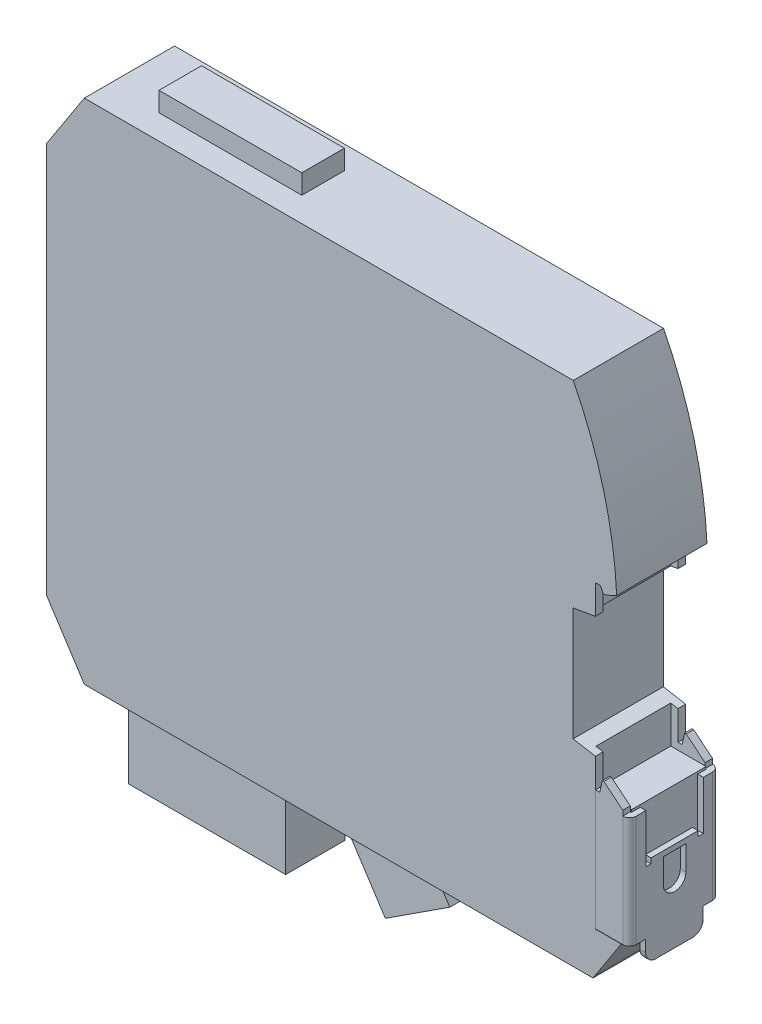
ISO-10303-21;
HEADER;
FILE_DESCRIPTION(('STEP AP214'),'2;1');
FILE_NAME('part.step','',(''),(''),'','','');
FILE_SCHEMA(('AUTOMOTIVE_DESIGN { 1 0 10303 214 1 1 1 1 }'));
ENDSEC;
DATA;
#1=APPLICATION_CONTEXT('core data for automotive mechanical design processes');
#2=APPLICATION_PROTOCOL_DEFINITION('international standard','automotive_design',2000,#1);
#3=PRODUCT_CONTEXT('',#1,'mechanical');
#4=PRODUCT('Part','Part','',(#3));
#5=PRODUCT_RELATED_PRODUCT_CATEGORY('part','',(#4));
#6=PRODUCT_DEFINITION_FORMATION('','',#4);
#7=PRODUCT_DEFINITION_CONTEXT('part definition',#1,'design');
#8=PRODUCT_DEFINITION('design','',#6,#7);
#9=PRODUCT_DEFINITION_SHAPE('','',#8);
#10=(LENGTH_UNIT() NAMED_UNIT(*) SI_UNIT(.MILLI.,.METRE.));
#11=(NAMED_UNIT(*) PLANE_ANGLE_UNIT() SI_UNIT($,.RADIAN.));
#12=(NAMED_UNIT(*) SI_UNIT($,.STERADIAN.) SOLID_ANGLE_UNIT());
#13=UNCERTAINTY_MEASURE_WITH_UNIT(LENGTH_MEASURE(1.E-05),#10,'distance_accuracy_value','');
#14=(GEOMETRIC_REPRESENTATION_CONTEXT(3) GLOBAL_UNCERTAINTY_ASSIGNED_CONTEXT((#13)) GLOBAL_UNIT_ASSIGNED_CONTEXT((#10,
#11,#12)) REPRESENTATION_CONTEXT('',''));
#15=CARTESIAN_POINT('',(0.,0.,0.));
#16=DIRECTION('',(0.,0.,1.));
#17=DIRECTION('',(1.,0.,0.));
#18=AXIS2_PLACEMENT_3D('',#15,#16,#17);
#19=CARTESIAN_POINT('',(0.,30.20000000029,8.8));
#20=DIRECTION('',(0.,1.,0.));
#21=DIRECTION('',(0.,0.,1.));
#22=AXIS2_PLACEMENT_3D('',#19,#20,#21);
#23=PLANE('',#22);
#24=DIRECTION('',(0.,0.,-1.));
#25=VECTOR('',#24,1.);
#26=CARTESIAN_POINT('',(112.300000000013,30.20000000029,8.8));
#27=LINE('',#26,#25);
#28=CARTESIAN_POINT('',(112.300000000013,30.20000000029,8.75));
#29=VERTEX_POINT('',#28);
#30=CARTESIAN_POINT('',(112.300000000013,30.20000000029,7.3));
#31=VERTEX_POINT('',#30);
#32=EDGE_CURVE('E1150',#29,#31,#27,.T.);
#33=ORIENTED_EDGE('',*,*,#32,.F.);
#34=CARTESIAN_POINT('',(112.300000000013,30.20000000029,7.4499999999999));
#35=DIRECTION('',(0.,1.,0.));
#36=DIRECTION('',(0.,0.,1.));
#37=AXIS2_PLACEMENT_3D('',#34,#35,#36);
#38=CIRCLE('',#37,1.3);
#39=CARTESIAN_POINT('',(113.600000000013,30.20000000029,7.4499999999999));
#40=VERTEX_POINT('',#39);
#41=EDGE_CURVE('E12',#29,#40,#38,.T.);
#42=ORIENTED_EDGE('',*,*,#41,.T.);
#43=DIRECTION('',(0.,0.,-1.));
#44=VECTOR('',#43,1.);
#45=CARTESIAN_POINT('',(113.600000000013,30.20000000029,8.8));
#46=LINE('',#45,#44);
#47=CARTESIAN_POINT('',(113.600000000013,30.20000000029,5.54999999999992));
#48=VERTEX_POINT('',#47);
#49=EDGE_CURVE('E1154',#40,#48,#46,.T.);
#50=ORIENTED_EDGE('',*,*,#49,.T.);
#51=DIRECTION('',(1.,0.,0.));
#52=VECTOR('',#51,1.);
#53=CARTESIAN_POINT('',(112.500000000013,30.20000000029,5.54999999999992));
#54=LINE('',#53,#52);
#55=CARTESIAN_POINT('',(112.500000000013,30.20000000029,5.54999999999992));
#56=VERTEX_POINT('',#55);
#57=EDGE_CURVE('E597',#56,#48,#54,.T.);
#58=ORIENTED_EDGE('',*,*,#57,.F.);
#59=DIRECTION('',(0.,0.,-1.));
#60=VECTOR('',#59,1.);
#61=CARTESIAN_POINT('',(112.500000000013,30.20000000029,-7.3));
#62=LINE('',#61,#60);
#63=CARTESIAN_POINT('',(112.500000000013,30.20000000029,7.3));
#64=VERTEX_POINT('',#63);
#65=EDGE_CURVE('E589',#64,#56,#62,.T.);
#66=ORIENTED_EDGE('',*,*,#65,.F.);
#67=DIRECTION('',(-1.,0.,0.));
#68=VECTOR('',#67,1.);
#69=CARTESIAN_POINT('',(127.106933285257,30.20000000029,7.3));
#70=LINE('',#69,#68);
#71=EDGE_CURVE('E574',#64,#31,#70,.T.);
#72=ORIENTED_EDGE('',*,*,#71,.T.);
#73=EDGE_LOOP('',(#33,#42,#50,#58,#66,#72));
#74=FACE_BOUND('',#73,.T.);
#75=ADVANCED_FACE('F60',(#74),#23,.T.);
#76=CARTESIAN_POINT('',(113.600000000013,30.20000000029,-5.65000000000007));
#77=VERTEX_POINT('',#76);
#78=CARTESIAN_POINT('',(113.600000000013,30.20000000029,-7.45000000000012));
#79=VERTEX_POINT('',#78);
#80=EDGE_CURVE('E1152',#77,#79,#46,.T.);
#81=ORIENTED_EDGE('',*,*,#80,.T.);
#82=CARTESIAN_POINT('',(112.300000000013,30.20000000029,-7.45000000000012));
#83=DIRECTION('',(0.,1.,0.));
#84=DIRECTION('',(0.,0.,1.));
#85=AXIS2_PLACEMENT_3D('',#82,#83,#84);
#86=CIRCLE('',#85,1.3);
#87=CARTESIAN_POINT('',(112.300000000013,30.20000000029,-8.75));
#88=VERTEX_POINT('',#87);
#89=EDGE_CURVE('E1230',#79,#88,#86,.T.);
#90=ORIENTED_EDGE('',*,*,#89,.T.);
#91=CARTESIAN_POINT('',(112.300000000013,30.20000000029,-7.3));
#92=VERTEX_POINT('',#91);
#93=EDGE_CURVE('E1149',#92,#88,#27,.T.);
#94=ORIENTED_EDGE('',*,*,#93,.F.);
#95=DIRECTION('',(-1.,0.,0.));
#96=VECTOR('',#95,1.);
#97=CARTESIAN_POINT('',(127.106933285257,30.20000000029,-7.3));
#98=LINE('',#97,#96);
#99=CARTESIAN_POINT('',(112.500000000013,30.20000000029,-7.3));
#100=VERTEX_POINT('',#99);
#101=EDGE_CURVE('E609',#100,#92,#98,.T.);
#102=ORIENTED_EDGE('',*,*,#101,.F.);
#103=CARTESIAN_POINT('',(112.500000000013,30.20000000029,-5.65000000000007));
#104=VERTEX_POINT('',#103);
#105=EDGE_CURVE('E583',#104,#100,#62,.T.);
#106=ORIENTED_EDGE('',*,*,#105,.F.);
#107=DIRECTION('',(1.,0.,0.));
#108=VECTOR('',#107,1.);
#109=CARTESIAN_POINT('',(112.500000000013,30.20000000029,-5.65000000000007));
#110=LINE('',#109,#108);
#111=EDGE_CURVE('E798',#104,#77,#110,.T.);
#112=ORIENTED_EDGE('',*,*,#111,.T.);
#113=EDGE_LOOP('',(#81,#90,#94,#102,#106,#112));
#114=FACE_BOUND('',#113,.T.);
#115=ADVANCED_FACE('F1365',(#114),#23,.T.);
#116=CARTESIAN_POINT('',(112.300000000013,0.,8.8));
#117=DIRECTION('',(1.,0.,0.));
#118=DIRECTION('',(0.,0.,-1.));
#119=AXIS2_PLACEMENT_3D('',#116,#117,#118);
#120=PLANE('',#119);
#121=DIRECTION('',(0.,1.,0.));
#122=VECTOR('',#121,1.);
#123=CARTESIAN_POINT('',(112.300000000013,65.8999999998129,-7.3));
#124=LINE('',#123,#122);
#125=CARTESIAN_POINT('',(112.300000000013,30.6499999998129,-7.3));
#126=VERTEX_POINT('',#125);
#127=CARTESIAN_POINT('',(112.300000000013,31.20000000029,-7.3));
#128=VERTEX_POINT('',#127);
#129=EDGE_CURVE('E672',#126,#128,#124,.T.);
#130=ORIENTED_EDGE('',*,*,#129,.F.);
#131=DIRECTION('',(0.,1.,0.));
#132=VECTOR('',#131,1.);
#133=CARTESIAN_POINT('',(112.300000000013,30.6499999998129,-7.3));
#134=LINE('',#133,#132);
#135=EDGE_CURVE('E607',#92,#126,#134,.T.);
#136=ORIENTED_EDGE('',*,*,#135,.F.);
#137=ORIENTED_EDGE('',*,*,#93,.T.);
#138=DIRECTION('',(0.,-1.,0.));
#139=VECTOR('',#138,1.);
#140=CARTESIAN_POINT('',(112.300000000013,0.,-8.75));
#141=LINE('',#140,#139);
#142=CARTESIAN_POINT('',(112.300000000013,31.20000000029,-8.75));
#143=VERTEX_POINT('',#142);
#144=EDGE_CURVE('E652',#143,#88,#141,.T.);
#145=ORIENTED_EDGE('',*,*,#144,.F.);
#146=DIRECTION('',(0.,0.,-1.));
#147=VECTOR('',#146,1.);
#148=CARTESIAN_POINT('',(112.300000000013,31.20000000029,8.8));
#149=LINE('',#148,#147);
#150=EDGE_CURVE('E1146',#128,#143,#149,.T.);
#151=ORIENTED_EDGE('',*,*,#150,.F.);
#152=EDGE_LOOP('',(#130,#136,#137,#145,#151));
#153=FACE_BOUND('',#152,.T.);
#154=ADVANCED_FACE('F1370',(#153),#120,.T.);
#155=ORIENTED_EDGE('',*,*,#32,.T.);
#156=DIRECTION('',(0.,-1.,0.));
#157=VECTOR('',#156,1.);
#158=CARTESIAN_POINT('',(112.300000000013,30.6499999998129,7.3));
#159=LINE('',#158,#157);
#160=CARTESIAN_POINT('',(112.300000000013,30.6499999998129,7.3));
#161=VERTEX_POINT('',#160);
#162=EDGE_CURVE('E580',#161,#31,#159,.T.);
#163=ORIENTED_EDGE('',*,*,#162,.F.);
#164=DIRECTION('',(0.,-1.,0.));
#165=VECTOR('',#164,1.);
#166=CARTESIAN_POINT('',(112.300000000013,65.8999999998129,7.3));
#167=LINE('',#166,#165);
#168=CARTESIAN_POINT('',(112.300000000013,31.20000000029,7.3));
#169=VERTEX_POINT('',#168);
#170=EDGE_CURVE('E655',#169,#161,#167,.T.);
#171=ORIENTED_EDGE('',*,*,#170,.F.);
#172=CARTESIAN_POINT('',(112.300000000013,31.20000000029,8.75));
#173=VERTEX_POINT('',#172);
#174=EDGE_CURVE('E1147',#173,#169,#149,.T.);
#175=ORIENTED_EDGE('',*,*,#174,.F.);
#176=DIRECTION('',(0.,1.,0.));
#177=VECTOR('',#176,1.);
#178=CARTESIAN_POINT('',(112.300000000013,0.,8.75));
#179=LINE('',#178,#177);
#180=EDGE_CURVE('E621',#29,#173,#179,.T.);
#181=ORIENTED_EDGE('',*,*,#180,.F.);
#182=EDGE_LOOP('',(#155,#163,#171,#175,#181));
#183=FACE_BOUND('',#182,.T.);
#184=ADVANCED_FACE('F1241',(#183),#120,.T.);
#185=CARTESIAN_POINT('',(59.8069634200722,73.761921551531,8.8));
#186=DIRECTION('',(0.62980195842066,0.776755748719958,0.));
#187=DIRECTION('',(-0.776755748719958,0.62980195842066,0.));
#188=AXIS2_PLACEMENT_3D('',#185,#186,#187);
#189=PLANE('',#188);
#190=DIRECTION('',(-0.776755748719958,0.62980195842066,0.));
#191=VECTOR('',#190,1.);
#192=CARTESIAN_POINT('',(59.8069634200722,73.761921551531,8.75));
#193=LINE('',#192,#191);
#194=CARTESIAN_POINT('',(108.600000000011,34.2000000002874,8.75));
#195=VERTEX_POINT('',#194);
#196=EDGE_CURVE('E634',#173,#195,#193,.T.);
#197=ORIENTED_EDGE('',*,*,#196,.F.);
#198=ORIENTED_EDGE('',*,*,#174,.T.);
#199=DIRECTION('',(0.776755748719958,-0.62980195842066,0.));
#200=VECTOR('',#199,1.);
#201=CARTESIAN_POINT('',(59.8069634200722,73.761921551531,7.3));
#202=LINE('',#201,#200);
#203=CARTESIAN_POINT('',(108.600000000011,34.2000000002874,7.3));
#204=VERTEX_POINT('',#203);
#205=EDGE_CURVE('E723',#204,#169,#202,.T.);
#206=ORIENTED_EDGE('',*,*,#205,.F.);
#207=DIRECTION('',(0.,0.,-1.));
#208=VECTOR('',#207,1.);
#209=CARTESIAN_POINT('',(108.600000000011,34.2000000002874,8.8));
#210=LINE('',#209,#208);
#211=EDGE_CURVE('E1144',#195,#204,#210,.T.);
#212=ORIENTED_EDGE('',*,*,#211,.F.);
#213=EDGE_LOOP('',(#197,#198,#206,#212));
#214=FACE_BOUND('',#213,.T.);
#215=ADVANCED_FACE('F1245',(#214),#189,.T.);
#216=CARTESIAN_POINT('',(0.,34.2000000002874,8.8));
#217=DIRECTION('',(0.,1.,0.));
#218=DIRECTION('',(0.,0.,1.));
#219=AXIS2_PLACEMENT_3D('',#216,#217,#218);
#220=PLANE('',#219);
#221=DIRECTION('',(-1.,0.,0.));
#222=VECTOR('',#221,1.);
#223=CARTESIAN_POINT('',(0.,34.2000000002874,8.75));
#224=LINE('',#223,#222);
#225=CARTESIAN_POINT('',(108.300000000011,34.2000000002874,8.75));
#226=VERTEX_POINT('',#225);
#227=EDGE_CURVE('E636',#195,#226,#224,.T.);
#228=ORIENTED_EDGE('',*,*,#227,.F.);
#229=ORIENTED_EDGE('',*,*,#211,.T.);
#230=DIRECTION('',(1.,0.,0.));
#231=VECTOR('',#230,1.);
#232=CARTESIAN_POINT('',(0.,34.2000000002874,7.3));
#233=LINE('',#232,#231);
#234=CARTESIAN_POINT('',(108.300000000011,34.2000000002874,7.3));
#235=VERTEX_POINT('',#234);
#236=EDGE_CURVE('E720',#235,#204,#233,.T.);
#237=ORIENTED_EDGE('',*,*,#236,.F.);
#238=DIRECTION('',(0.,0.,-1.));
#239=VECTOR('',#238,1.);
#240=CARTESIAN_POINT('',(108.300000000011,34.2000000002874,8.8));
#241=LINE('',#240,#239);
#242=EDGE_CURVE('E1141',#226,#235,#241,.T.);
#243=ORIENTED_EDGE('',*,*,#242,.F.);
#244=EDGE_LOOP('',(#228,#229,#237,#243));
#245=FACE_BOUND('',#244,.T.);
#246=ADVANCED_FACE('F1255',(#245),#220,.T.);
#247=CARTESIAN_POINT('',(95.5897838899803,-21.7249508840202,8.8));
#248=DIRECTION('',(-0.975132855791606,0.221621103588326,0.));
#249=DIRECTION('',(-0.221621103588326,-0.975132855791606,0.));
#250=AXIS2_PLACEMENT_3D('',#247,#248,#249);
#251=PLANE('',#250);
#252=DIRECTION('',(-0.221621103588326,-0.975132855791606,0.));
#253=VECTOR('',#252,1.);
#254=CARTESIAN_POINT('',(95.5897838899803,-21.7249508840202,8.75));
#255=LINE('',#254,#253);
#256=CARTESIAN_POINT('',(107.800000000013,32.0000000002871,8.75));
#257=VERTEX_POINT('',#256);
#258=EDGE_CURVE('E638',#226,#257,#255,.T.);
#259=ORIENTED_EDGE('',*,*,#258,.F.);
#260=ORIENTED_EDGE('',*,*,#242,.T.);
#261=DIRECTION('',(0.221621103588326,0.975132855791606,0.));
#262=VECTOR('',#261,1.);
#263=CARTESIAN_POINT('',(95.5897838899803,-21.7249508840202,7.29999999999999));
#264=LINE('',#263,#262);
#265=CARTESIAN_POINT('',(107.800000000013,32.0000000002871,7.3));
#266=VERTEX_POINT('',#265);
#267=EDGE_CURVE('E717',#266,#235,#264,.T.);
#268=ORIENTED_EDGE('',*,*,#267,.F.);
#269=DIRECTION('',(0.,0.,-1.));
#270=VECTOR('',#269,1.);
#271=CARTESIAN_POINT('',(107.800000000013,32.0000000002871,8.8));
#272=LINE('',#271,#270);
#273=EDGE_CURVE('E1138',#257,#266,#272,.T.);
#274=ORIENTED_EDGE('',*,*,#273,.F.);
#275=EDGE_LOOP('',(#259,#260,#268,#274));
#276=FACE_BOUND('',#275,.T.);
#277=ADVANCED_FACE('F1260',(#276),#251,.T.);
#278=CARTESIAN_POINT('',(0.,32.0000000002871,8.8));
#279=DIRECTION('',(0.,1.,0.));
#280=DIRECTION('',(0.,0.,1.));
#281=AXIS2_PLACEMENT_3D('',#278,#279,#280);
#282=PLANE('',#281);
#283=DIRECTION('',(-1.,0.,0.));
#284=VECTOR('',#283,1.);
#285=CARTESIAN_POINT('',(0.,32.0000000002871,8.75));
#286=LINE('',#285,#284);
#287=CARTESIAN_POINT('',(107.000000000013,32.0000000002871,8.75));
#288=VERTEX_POINT('',#287);
#289=EDGE_CURVE('E640',#257,#288,#286,.T.);
#290=ORIENTED_EDGE('',*,*,#289,.F.);
#291=ORIENTED_EDGE('',*,*,#273,.T.);
#292=DIRECTION('',(1.,0.,0.));
#293=VECTOR('',#292,1.);
#294=CARTESIAN_POINT('',(0.,32.0000000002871,7.3));
#295=LINE('',#294,#293);
#296=CARTESIAN_POINT('',(106.999999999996,32.0000000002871,7.3));
#297=VERTEX_POINT('',#296);
#298=EDGE_CURVE('E714',#297,#266,#295,.T.);
#299=ORIENTED_EDGE('',*,*,#298,.F.);
#300=DIRECTION('',(0.,0.,-1.));
#301=VECTOR('',#300,1.);
#302=CARTESIAN_POINT('',(107.000000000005,32.0000000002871,8.8));
#303=LINE('',#302,#301);
#304=EDGE_CURVE('E1135',#288,#297,#303,.T.);
#305=ORIENTED_EDGE('',*,*,#304,.F.);
#306=EDGE_LOOP('',(#290,#291,#299,#305));
#307=FACE_BOUND('',#306,.T.);
#308=ADVANCED_FACE('F1263',(#307),#282,.T.);
#309=CARTESIAN_POINT('',(106.999999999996,0.,8.8));
#310=DIRECTION('',(-1.,0.,0.));
#311=DIRECTION('',(0.,0.,1.));
#312=AXIS2_PLACEMENT_3D('',#309,#310,#311);
#313=PLANE('',#312);
#314=DIRECTION('',(0.,0.,-1.));
#315=VECTOR('',#314,1.);
#316=CARTESIAN_POINT('',(106.999999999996,37.6829776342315,8.8));
#317=LINE('',#316,#315);
#318=CARTESIAN_POINT('',(106.999999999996,37.6829776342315,8.8));
#319=VERTEX_POINT('',#318);
#320=CARTESIAN_POINT('',(106.999999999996,37.6829776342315,7.3));
#321=VERTEX_POINT('',#320);
#322=EDGE_CURVE('E1131',#319,#321,#317,.T.);
#323=ORIENTED_EDGE('',*,*,#322,.F.);
#324=DIRECTION('',(0.,1.,0.));
#325=VECTOR('',#324,1.);
#326=CARTESIAN_POINT('',(106.999999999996,0.,8.8));
#327=LINE('',#326,#325);
#328=CARTESIAN_POINT('',(107.000000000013,8.50000000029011,8.8));
#329=VERTEX_POINT('',#328);
#330=EDGE_CURVE('E1034',#329,#319,#327,.T.);
#331=ORIENTED_EDGE('',*,*,#330,.F.);
#332=DIRECTION('',(0.,0.,-1.));
#333=VECTOR('',#332,1.);
#334=CARTESIAN_POINT('',(107.000000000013,8.50000000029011,8.8));
#335=LINE('',#334,#333);
#336=CARTESIAN_POINT('',(107.000000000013,8.50000000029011,8.75));
#337=VERTEX_POINT('',#336);
#338=EDGE_CURVE('E593',#329,#337,#335,.T.);
#339=ORIENTED_EDGE('',*,*,#338,.T.);
#340=DIRECTION('',(0.,1.,0.));
#341=VECTOR('',#340,1.);
#342=CARTESIAN_POINT('',(107.000000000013,8.50000000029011,8.75));
#343=LINE('',#342,#341);
#344=EDGE_CURVE('E626',#337,#288,#343,.T.);
#345=ORIENTED_EDGE('',*,*,#344,.T.);
#346=ORIENTED_EDGE('',*,*,#304,.T.);
#347=DIRECTION('',(0.,1.,0.));
#348=VECTOR('',#347,1.);
#349=CARTESIAN_POINT('',(106.999999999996,0.,7.29999999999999));
#350=LINE('',#349,#348);
#351=EDGE_CURVE('E711',#297,#321,#350,.T.);
#352=ORIENTED_EDGE('',*,*,#351,.T.);
#353=EDGE_LOOP('',(#323,#331,#339,#345,#346,#352));
#354=FACE_BOUND('',#353,.T.);
#355=ADVANCED_FACE('F1270',(#354),#313,.F.);
#356=CARTESIAN_POINT('',(0.,0.,8.8));
#357=DIRECTION('',(0.,0.,1.));
#358=DIRECTION('',(1.,0.,0.));
#359=AXIS2_PLACEMENT_3D('',#356,#357,#358);
#360=PLANE('',#359);
#361=DIRECTION('',(1.,0.,0.));
#362=VECTOR('',#361,1.);
#363=CARTESIAN_POINT('',(107.000000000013,8.50000000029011,8.8));
#364=LINE('',#363,#362);
#365=CARTESIAN_POINT('',(112.050968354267,8.50000000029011,8.8));
#366=VERTEX_POINT('',#365);
#367=EDGE_CURVE('E629',#329,#366,#364,.T.);
#368=ORIENTED_EDGE('',*,*,#367,.F.);
#369=ORIENTED_EDGE('',*,*,#330,.T.);
#370=DIRECTION('',(0.984807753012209,-0.173648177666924,0.));
#371=VECTOR('',#370,1.);
#372=CARTESIAN_POINT('',(9.67061349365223,54.8447744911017,8.8));
#373=LINE('',#372,#371);
#374=CARTESIAN_POINT('',(102.649999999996,38.4500000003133,8.8));
#375=VERTEX_POINT('',#374);
#376=EDGE_CURVE('E1036',#375,#319,#373,.T.);
#377=ORIENTED_EDGE('',*,*,#376,.F.);
#378=DIRECTION('',(0.,-1.,0.));
#379=VECTOR('',#378,1.);
#380=CARTESIAN_POINT('',(102.649999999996,0.,8.8));
#381=LINE('',#380,#379);
#382=CARTESIAN_POINT('',(102.649999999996,60.5500000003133,8.8));
#383=VERTEX_POINT('',#382);
#384=EDGE_CURVE('E1039',#383,#375,#381,.T.);
#385=ORIENTED_EDGE('',*,*,#384,.F.);
#386=DIRECTION('',(-0.984807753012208,-0.173648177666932,0.));
#387=VECTOR('',#386,1.);
#388=CARTESIAN_POINT('',(-7.25938360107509,41.1700102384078,8.8));
#389=LINE('',#388,#387);
#390=CARTESIAN_POINT('',(106.999999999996,61.3170223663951,8.8));
#391=VERTEX_POINT('',#390);
#392=EDGE_CURVE('E1042',#391,#383,#389,.T.);
#393=ORIENTED_EDGE('',*,*,#392,.F.);
#394=DIRECTION('',(0.,-1.,0.));
#395=VECTOR('',#394,1.);
#396=CARTESIAN_POINT('',(106.999999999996,0.,8.8));
#397=LINE('',#396,#395);
#398=CARTESIAN_POINT('',(106.999999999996,66.9999999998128,8.8));
#399=VERTEX_POINT('',#398);
#400=EDGE_CURVE('E1045',#399,#391,#397,.T.);
#401=ORIENTED_EDGE('',*,*,#400,.F.);
#402=DIRECTION('',(-1.,0.,0.));
#403=VECTOR('',#402,1.);
#404=CARTESIAN_POINT('',(0.,66.9999999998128,8.8));
#405=LINE('',#404,#403);
#406=CARTESIAN_POINT('',(107.999999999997,66.9999999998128,8.8));
#407=VERTEX_POINT('',#406);
#408=EDGE_CURVE('E1048',#407,#399,#405,.T.);
#409=ORIENTED_EDGE('',*,*,#408,.F.);
#410=DIRECTION('',(-0.422618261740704,0.906307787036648,0.));
#411=VECTOR('',#410,1.);
#412=CARTESIAN_POINT('',(114.373019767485,53.333015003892,8.8));
#413=LINE('',#412,#411);
#414=CARTESIAN_POINT('',(108.512938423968,65.8999999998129,8.8));
#415=VERTEX_POINT('',#414);
#416=EDGE_CURVE('E1051',#415,#407,#413,.T.);
#417=ORIENTED_EDGE('',*,*,#416,.F.);
#418=DIRECTION('',(-1.,0.,0.));
#419=VECTOR('',#418,1.);
#420=CARTESIAN_POINT('',(0.,65.8999999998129,8.8));
#421=LINE('',#420,#419);
#422=CARTESIAN_POINT('',(108.999999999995,65.8999999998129,8.8));
#423=VERTEX_POINT('',#422);
#424=EDGE_CURVE('E1054',#423,#415,#421,.T.);
#425=ORIENTED_EDGE('',*,*,#424,.F.);
#426=DIRECTION('',(-0.906307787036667,-0.422618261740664,0.));
#427=VECTOR('',#426,1.);
#428=CARTESIAN_POINT('',(-5.77308912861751,12.38042958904,8.8));
#429=LINE('',#428,#427);
#430=CARTESIAN_POINT('',(111.154649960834,66.9047297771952,8.8));
#431=VERTEX_POINT('',#430);
#432=EDGE_CURVE('E1057',#431,#423,#429,.T.);
#433=ORIENTED_EDGE('',*,*,#432,.F.);
#434=CARTESIAN_POINT('',(31.2499999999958,62.9999999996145,8.8));
#435=DIRECTION('',(0.,0.,1.));
#436=DIRECTION('',(1.,0.,0.));
#437=AXIS2_PLACEMENT_3D('',#434,#435,#436);
#438=CIRCLE('',#437,80.);
#439=CARTESIAN_POINT('',(102.692284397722,99.0000000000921,8.8));
#440=VERTEX_POINT('',#439);
#441=EDGE_CURVE('E1060',#440,#431,#438,.F.);
#442=ORIENTED_EDGE('',*,*,#441,.F.);
#443=DIRECTION('',(1.,0.,0.));
#444=VECTOR('',#443,1.);
#445=CARTESIAN_POINT('',(0.,99.0000000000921,8.8));
#446=LINE('',#445,#444);
#447=CARTESIAN_POINT('',(7.33830580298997,99.0000000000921,8.8));
#448=VERTEX_POINT('',#447);
#449=EDGE_CURVE('E1012',#448,#440,#446,.T.);
#450=ORIENTED_EDGE('',*,*,#449,.F.);
#451=DIRECTION('',(0.54463903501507,0.838670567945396,0.));
#452=VECTOR('',#451,1.);
#453=CARTESIAN_POINT('',(-40.0589683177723,26.0145982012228,8.8));
#454=LINE('',#453,#452);
#455=CARTESIAN_POINT('',(0.,87.7000000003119,8.8));
#456=VERTEX_POINT('',#455);
#457=EDGE_CURVE('E1015',#456,#448,#454,.T.);
#458=ORIENTED_EDGE('',*,*,#457,.F.);
#459=DIRECTION('',(0.,1.,0.));
#460=VECTOR('',#459,1.);
#461=CARTESIAN_POINT('',(0.,0.,8.8));
#462=LINE('',#461,#460);
#463=CARTESIAN_POINT('',(0.,11.3000000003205,8.8));
#464=VERTEX_POINT('',#463);
#465=EDGE_CURVE('E1019',#464,#456,#462,.T.);
#466=ORIENTED_EDGE('',*,*,#465,.F.);
#467=DIRECTION('',(-0.544639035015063,0.838670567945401,0.));
#468=VECTOR('',#467,1.);
#469=CARTESIAN_POINT('',(5.16153183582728,3.35193796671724,8.8));
#470=LINE('',#469,#468);
#471=CARTESIAN_POINT('',(7.3383058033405,2.91433543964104E-13,8.8));
#472=VERTEX_POINT('',#471);
#473=EDGE_CURVE('E1022',#472,#464,#470,.T.);
#474=ORIENTED_EDGE('',*,*,#473,.F.);
#475=DIRECTION('',(-1.,0.,0.));
#476=VECTOR('',#475,1.);
#477=CARTESIAN_POINT('',(0.,3.28852457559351E-13,8.8));
#478=LINE('',#477,#476);
#479=CARTESIAN_POINT('',(106.525450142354,0.,8.8));
#480=VERTEX_POINT('',#479);
#481=EDGE_CURVE('E1025',#480,#472,#478,.T.);
#482=ORIENTED_EDGE('',*,*,#481,.F.);
#483=DIRECTION('',(-0.544639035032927,-0.8386705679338,0.));
#484=VECTOR('',#483,1.);
#485=CARTESIAN_POINT('',(74.9266270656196,-48.6579205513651,8.8));
#486=LINE('',#485,#484);
#487=CARTESIAN_POINT('',(106.999999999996,0.730742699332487,8.8));
#488=VERTEX_POINT('',#487);
#489=EDGE_CURVE('E1028',#488,#480,#486,.T.);
#490=ORIENTED_EDGE('',*,*,#489,.F.);
#491=DIRECTION('',(-0.545060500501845,-0.838396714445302,0.));
#492=VECTOR('',#491,1.);
#493=CARTESIAN_POINT('',(74.8773358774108,-48.6794347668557,8.8));
#494=LINE('',#493,#492);
#495=EDGE_CURVE('E1031',#366,#488,#494,.T.);
#496=ORIENTED_EDGE('',*,*,#495,.F.);
#497=EDGE_LOOP('',(#368,#369,#377,#385,#393,#401,#409,#417,#425,#433,#442,#450,#458,#466,#474,
#482,#490,#496));
#498=FACE_BOUND('',#497,.T.);
#499=ADVANCED_FACE('F1278',(#498),#360,.T.);
#500=CARTESIAN_POINT('',(0.,0.,-8.8));
#501=DIRECTION('',(0.,0.,1.));
#502=DIRECTION('',(1.,0.,0.));
#503=AXIS2_PLACEMENT_3D('',#500,#501,#502);
#504=PLANE('',#503);
#505=DIRECTION('',(0.,1.,0.));
#506=VECTOR('',#505,1.);
#507=CARTESIAN_POINT('',(106.999999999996,0.,-8.8));
#508=LINE('',#507,#506);
#509=CARTESIAN_POINT('',(107.000000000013,8.50000000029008,-8.8));
#510=VERTEX_POINT('',#509);
#511=CARTESIAN_POINT('',(106.999999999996,37.6829776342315,-8.8));
#512=VERTEX_POINT('',#511);
#513=EDGE_CURVE('E1082',#510,#512,#508,.T.);
#514=ORIENTED_EDGE('',*,*,#513,.F.);
#515=DIRECTION('',(1.,0.,0.));
#516=VECTOR('',#515,1.);
#517=CARTESIAN_POINT('',(107.000000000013,8.50000000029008,-8.8));
#518=LINE('',#517,#516);
#519=CARTESIAN_POINT('',(112.050968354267,8.50000000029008,-8.8));
#520=VERTEX_POINT('',#519);
#521=EDGE_CURVE('E618',#510,#520,#518,.T.);
#522=ORIENTED_EDGE('',*,*,#521,.T.);
#523=DIRECTION('',(-0.545060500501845,-0.838396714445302,0.));
#524=VECTOR('',#523,1.);
#525=CARTESIAN_POINT('',(74.8773358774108,-48.6794347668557,-8.8));
#526=LINE('',#525,#524);
#527=CARTESIAN_POINT('',(106.999999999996,0.730742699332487,-8.8));
#528=VERTEX_POINT('',#527);
#529=EDGE_CURVE('E1079',#520,#528,#526,.T.);
#530=ORIENTED_EDGE('',*,*,#529,.T.);
#531=DIRECTION('',(-0.544639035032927,-0.8386705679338,0.));
#532=VECTOR('',#531,1.);
#533=CARTESIAN_POINT('',(74.9266270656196,-48.6579205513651,-8.8));
#534=LINE('',#533,#532);
#535=CARTESIAN_POINT('',(106.525450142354,0.,-8.8));
#536=VERTEX_POINT('',#535);
#537=EDGE_CURVE('E1076',#528,#536,#534,.T.);
#538=ORIENTED_EDGE('',*,*,#537,.T.);
#539=DIRECTION('',(-1.,0.,0.));
#540=VECTOR('',#539,1.);
#541=CARTESIAN_POINT('',(0.,3.28852457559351E-13,-8.8));
#542=LINE('',#541,#540);
#543=CARTESIAN_POINT('',(7.3383058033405,2.91433543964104E-13,-8.8));
#544=VERTEX_POINT('',#543);
#545=EDGE_CURVE('E1074',#536,#544,#542,.T.);
#546=ORIENTED_EDGE('',*,*,#545,.T.);
#547=DIRECTION('',(-0.544639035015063,0.838670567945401,0.));
#548=VECTOR('',#547,1.);
#549=CARTESIAN_POINT('',(5.16153183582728,3.35193796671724,-8.8));
#550=LINE('',#549,#548);
#551=CARTESIAN_POINT('',(0.,11.3000000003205,-8.8));
#552=VERTEX_POINT('',#551);
#553=EDGE_CURVE('E1071',#544,#552,#550,.T.);
#554=ORIENTED_EDGE('',*,*,#553,.T.);
#555=DIRECTION('',(0.,1.,0.));
#556=VECTOR('',#555,1.);
#557=CARTESIAN_POINT('',(0.,0.,-8.8));
#558=LINE('',#557,#556);
#559=CARTESIAN_POINT('',(0.,87.7000000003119,-8.8));
#560=VERTEX_POINT('',#559);
#561=EDGE_CURVE('E1068',#552,#560,#558,.T.);
#562=ORIENTED_EDGE('',*,*,#561,.T.);
#563=DIRECTION('',(0.54463903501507,0.838670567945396,0.));
#564=VECTOR('',#563,1.);
#565=CARTESIAN_POINT('',(-40.0589683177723,26.0145982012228,-8.8));
#566=LINE('',#565,#564);
#567=CARTESIAN_POINT('',(7.33830580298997,99.0000000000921,-8.8));
#568=VERTEX_POINT('',#567);
#569=EDGE_CURVE('E1065',#560,#568,#566,.T.);
#570=ORIENTED_EDGE('',*,*,#569,.T.);
#571=DIRECTION('',(1.,0.,0.));
#572=VECTOR('',#571,1.);
#573=CARTESIAN_POINT('',(0.,99.0000000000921,-8.8));
#574=LINE('',#573,#572);
#575=CARTESIAN_POINT('',(102.692284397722,99.0000000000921,-8.8));
#576=VERTEX_POINT('',#575);
#577=EDGE_CURVE('E996',#568,#576,#574,.T.);
#578=ORIENTED_EDGE('',*,*,#577,.T.);
#579=CARTESIAN_POINT('',(31.2499999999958,62.9999999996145,-8.8));
#580=DIRECTION('',(0.,0.,1.));
#581=DIRECTION('',(1.,0.,0.));
#582=AXIS2_PLACEMENT_3D('',#579,#580,#581);
#583=CIRCLE('',#582,80.);
#584=CARTESIAN_POINT('',(111.154649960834,66.9047297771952,-8.8));
#585=VERTEX_POINT('',#584);
#586=EDGE_CURVE('E1016',#576,#585,#583,.F.);
#587=ORIENTED_EDGE('',*,*,#586,.T.);
#588=DIRECTION('',(-0.906307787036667,-0.422618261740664,0.));
#589=VECTOR('',#588,1.);
#590=CARTESIAN_POINT('',(-5.77308912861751,12.38042958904,-8.8));
#591=LINE('',#590,#589);
#592=CARTESIAN_POINT('',(108.999999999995,65.8999999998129,-8.8));
#593=VERTEX_POINT('',#592);
#594=EDGE_CURVE('E1105',#585,#593,#591,.T.);
#595=ORIENTED_EDGE('',*,*,#594,.T.);
#596=DIRECTION('',(-1.,0.,0.));
#597=VECTOR('',#596,1.);
#598=CARTESIAN_POINT('',(0.,65.8999999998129,-8.8));
#599=LINE('',#598,#597);
#600=CARTESIAN_POINT('',(108.512938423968,65.8999999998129,-8.8));
#601=VERTEX_POINT('',#600);
#602=EDGE_CURVE('E1102',#593,#601,#599,.T.);
#603=ORIENTED_EDGE('',*,*,#602,.T.);
#604=DIRECTION('',(-0.422618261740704,0.906307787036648,0.));
#605=VECTOR('',#604,1.);
#606=CARTESIAN_POINT('',(114.373019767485,53.333015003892,-8.8));
#607=LINE('',#606,#605);
#608=CARTESIAN_POINT('',(107.999999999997,66.9999999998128,-8.8));
#609=VERTEX_POINT('',#608);
#610=EDGE_CURVE('E1099',#601,#609,#607,.T.);
#611=ORIENTED_EDGE('',*,*,#610,.T.);
#612=DIRECTION('',(-1.,0.,0.));
#613=VECTOR('',#612,1.);
#614=CARTESIAN_POINT('',(0.,66.9999999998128,-8.8));
#615=LINE('',#614,#613);
#616=CARTESIAN_POINT('',(106.999999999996,66.9999999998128,-8.8));
#617=VERTEX_POINT('',#616);
#618=EDGE_CURVE('E1096',#609,#617,#615,.T.);
#619=ORIENTED_EDGE('',*,*,#618,.T.);
#620=DIRECTION('',(0.,-1.,0.));
#621=VECTOR('',#620,1.);
#622=CARTESIAN_POINT('',(106.999999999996,0.,-8.8));
#623=LINE('',#622,#621);
#624=CARTESIAN_POINT('',(106.999999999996,61.3170223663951,-8.8));
#625=VERTEX_POINT('',#624);
#626=EDGE_CURVE('E1093',#617,#625,#623,.T.);
#627=ORIENTED_EDGE('',*,*,#626,.T.);
#628=DIRECTION('',(-0.984807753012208,-0.173648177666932,0.));
#629=VECTOR('',#628,1.);
#630=CARTESIAN_POINT('',(-7.25938360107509,41.1700102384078,-8.8));
#631=LINE('',#630,#629);
#632=CARTESIAN_POINT('',(102.649999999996,60.5500000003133,-8.8));
#633=VERTEX_POINT('',#632);
#634=EDGE_CURVE('E1090',#625,#633,#631,.T.);
#635=ORIENTED_EDGE('',*,*,#634,.T.);
#636=DIRECTION('',(0.,-1.,0.));
#637=VECTOR('',#636,1.);
#638=CARTESIAN_POINT('',(102.649999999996,0.,-8.8));
#639=LINE('',#638,#637);
#640=CARTESIAN_POINT('',(102.649999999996,38.4500000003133,-8.8));
#641=VERTEX_POINT('',#640);
#642=EDGE_CURVE('E1087',#633,#641,#639,.T.);
#643=ORIENTED_EDGE('',*,*,#642,.T.);
#644=DIRECTION('',(0.984807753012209,-0.173648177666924,0.));
#645=VECTOR('',#644,1.);
#646=CARTESIAN_POINT('',(9.67061349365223,54.8447744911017,-8.8));
#647=LINE('',#646,#645);
#648=EDGE_CURVE('E1084',#641,#512,#647,.T.);
#649=ORIENTED_EDGE('',*,*,#648,.T.);
#650=EDGE_LOOP('',(#514,#522,#530,#538,#546,#554,#562,#570,#578,#587,#595,#603,#611,#619,#627,
#635,#643,#649));
#651=FACE_BOUND('',#650,.T.);
#652=ADVANCED_FACE('F1382',(#651),#504,.F.);
#653=CARTESIAN_POINT('',(0.,4.20000000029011,8.8));
#654=DIRECTION('',(0.,-1.,0.));
#655=DIRECTION('',(0.,0.,-1.));
#656=AXIS2_PLACEMENT_3D('',#653,#654,#655);
#657=PLANE('',#656);
#658=DIRECTION('',(0.,0.,-1.));
#659=VECTOR('',#658,1.);
#660=CARTESIAN_POINT('',(113.600000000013,4.20000000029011,8.8));
#661=LINE('',#660,#659);
#662=CARTESIAN_POINT('',(113.600000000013,4.20000000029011,3.59999999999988));
#663=VERTEX_POINT('',#662);
#664=CARTESIAN_POINT('',(113.600000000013,4.20000000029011,-3.60000000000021));
#665=VERTEX_POINT('',#664);
#666=EDGE_CURVE('E1155',#663,#665,#661,.T.);
#667=ORIENTED_EDGE('',*,*,#666,.F.);
#668=DIRECTION('',(1.,0.,0.));
#669=VECTOR('',#668,1.);
#670=CARTESIAN_POINT('',(112.500000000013,4.20000000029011,3.59999999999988));
#671=LINE('',#670,#669);
#672=CARTESIAN_POINT('',(112.500000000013,4.20000000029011,3.59999999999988));
#673=VERTEX_POINT('',#672);
#674=EDGE_CURVE('E822',#673,#663,#671,.T.);
#675=ORIENTED_EDGE('',*,*,#674,.F.);
#676=DIRECTION('',(0.,0.,-1.));
#677=VECTOR('',#676,1.);
#678=CARTESIAN_POINT('',(112.500000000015,4.20000000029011,8.8));
#679=LINE('',#678,#677);
#680=CARTESIAN_POINT('',(112.500000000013,4.20000000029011,-3.60000000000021));
#681=VERTEX_POINT('',#680);
#682=EDGE_CURVE('E1158',#673,#681,#679,.T.);
#683=ORIENTED_EDGE('',*,*,#682,.T.);
#684=DIRECTION('',(1.,0.,0.));
#685=VECTOR('',#684,1.);
#686=CARTESIAN_POINT('',(112.500000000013,4.20000000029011,-3.60000000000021));
#687=LINE('',#686,#685);
#688=EDGE_CURVE('E824',#681,#665,#687,.T.);
#689=ORIENTED_EDGE('',*,*,#688,.T.);
#690=EDGE_LOOP('',(#667,#675,#683,#689));
#691=FACE_BOUND('',#690,.T.);
#692=ADVANCED_FACE('F1379',(#691),#657,.T.);
#693=CARTESIAN_POINT('',(113.600000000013,0.,8.8));
#694=DIRECTION('',(1.,0.,0.));
#695=DIRECTION('',(0.,0.,-1.));
#696=AXIS2_PLACEMENT_3D('',#693,#694,#695);
#697=PLANE('',#696);
#698=DIRECTION('',(0.,0.,1.));
#699=VECTOR('',#698,1.);
#700=CARTESIAN_POINT('',(113.600000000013,8.50000000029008,0.));
#701=LINE('',#700,#699);
#702=CARTESIAN_POINT('',(113.600000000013,8.50000000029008,-7.44999999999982));
#703=VERTEX_POINT('',#702);
#704=CARTESIAN_POINT('',(113.600000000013,8.50000000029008,-5.60000000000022));
#705=VERTEX_POINT('',#704);
#706=EDGE_CURVE('E729',#703,#705,#701,.T.);
#707=ORIENTED_EDGE('',*,*,#706,.F.);
#708=DIRECTION('',(0.,-1.,0.));
#709=VECTOR('',#708,1.);
#710=CARTESIAN_POINT('',(113.600000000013,30.20000000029,-7.45000000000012));
#711=LINE('',#710,#709);
#712=EDGE_CURVE('E75',#703,#79,#711,.F.);
#713=ORIENTED_EDGE('',*,*,#712,.T.);
#714=ORIENTED_EDGE('',*,*,#80,.F.);
#715=DIRECTION('',(0.,1.,0.));
#716=VECTOR('',#715,1.);
#717=CARTESIAN_POINT('',(113.600000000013,0.,-5.65000000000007));
#718=LINE('',#717,#716);
#719=CARTESIAN_POINT('',(113.600000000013,20.70000000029,-5.65000000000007));
#720=VERTEX_POINT('',#719);
#721=EDGE_CURVE('E734',#720,#77,#718,.T.);
#722=ORIENTED_EDGE('',*,*,#721,.F.);
#723=DIRECTION('',(0.,0.,-1.));
#724=VECTOR('',#723,1.);
#725=CARTESIAN_POINT('',(113.600000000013,20.70000000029,0.));
#726=LINE('',#725,#724);
#727=CARTESIAN_POINT('',(113.600000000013,20.70000000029,-4.65000000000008));
#728=VERTEX_POINT('',#727);
#729=EDGE_CURVE('E794',#728,#720,#726,.T.);
#730=ORIENTED_EDGE('',*,*,#729,.F.);
#731=DIRECTION('',(0.,-1.,0.));
#732=VECTOR('',#731,1.);
#733=CARTESIAN_POINT('',(113.600000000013,0.,-4.65000000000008));
#734=LINE('',#733,#732);
#735=CARTESIAN_POINT('',(113.600000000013,21.70000000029,-4.65000000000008));
#736=VERTEX_POINT('',#735);
#737=EDGE_CURVE('E791',#736,#728,#734,.T.);
#738=ORIENTED_EDGE('',*,*,#737,.F.);
#739=DIRECTION('',(0.,0.,-1.));
#740=VECTOR('',#739,1.);
#741=CARTESIAN_POINT('',(113.600000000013,21.70000000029,0.));
#742=LINE('',#741,#740);
#743=CARTESIAN_POINT('',(113.600000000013,21.70000000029,4.54999999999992));
#744=VERTEX_POINT('',#743);
#745=EDGE_CURVE('E788',#744,#736,#742,.T.);
#746=ORIENTED_EDGE('',*,*,#745,.F.);
#747=DIRECTION('',(0.,1.,0.));
#748=VECTOR('',#747,1.);
#749=CARTESIAN_POINT('',(113.600000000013,0.,4.54999999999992));
#750=LINE('',#749,#748);
#751=CARTESIAN_POINT('',(113.600000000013,20.70000000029,4.54999999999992));
#752=VERTEX_POINT('',#751);
#753=EDGE_CURVE('E785',#752,#744,#750,.T.);
#754=ORIENTED_EDGE('',*,*,#753,.F.);
#755=DIRECTION('',(0.,0.,-1.));
#756=VECTOR('',#755,1.);
#757=CARTESIAN_POINT('',(113.600000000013,20.70000000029,0.));
#758=LINE('',#757,#756);
#759=CARTESIAN_POINT('',(113.600000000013,20.70000000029,5.54999999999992));
#760=VERTEX_POINT('',#759);
#761=EDGE_CURVE('E782',#760,#752,#758,.T.);
#762=ORIENTED_EDGE('',*,*,#761,.F.);
#763=DIRECTION('',(0.,-1.,0.));
#764=VECTOR('',#763,1.);
#765=CARTESIAN_POINT('',(113.600000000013,0.,5.54999999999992));
#766=LINE('',#765,#764);
#767=EDGE_CURVE('E779',#48,#760,#766,.T.);
#768=ORIENTED_EDGE('',*,*,#767,.F.);
#769=ORIENTED_EDGE('',*,*,#49,.F.);
#770=DIRECTION('',(0.,1.,0.));
#771=VECTOR('',#770,1.);
#772=CARTESIAN_POINT('',(113.600000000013,8.50000000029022,7.44999999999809));
#773=LINE('',#772,#771);
#774=CARTESIAN_POINT('',(113.600000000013,8.50000000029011,7.44999999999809));
#775=VERTEX_POINT('',#774);
#776=EDGE_CURVE('E1227',#40,#775,#773,.F.);
#777=ORIENTED_EDGE('',*,*,#776,.T.);
#778=DIRECTION('',(0.,0.,1.));
#779=VECTOR('',#778,1.);
#780=CARTESIAN_POINT('',(113.600000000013,8.50000000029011,0.));
#781=LINE('',#780,#779);
#782=CARTESIAN_POINT('',(113.600000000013,8.50000000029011,5.59999999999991));
#783=VERTEX_POINT('',#782);
#784=EDGE_CURVE('E776',#783,#775,#781,.T.);
#785=ORIENTED_EDGE('',*,*,#784,.F.);
#786=DIRECTION('',(0.,1.,0.));
#787=VECTOR('',#786,1.);
#788=CARTESIAN_POINT('',(113.600000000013,0.,5.59999999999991));
#789=LINE('',#788,#787);
#790=CARTESIAN_POINT('',(113.600000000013,6.20000000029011,5.59999999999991));
#791=VERTEX_POINT('',#790);
#792=EDGE_CURVE('E773',#791,#783,#789,.T.);
#793=ORIENTED_EDGE('',*,*,#792,.F.);
#794=CARTESIAN_POINT('',(113.600000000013,6.20000000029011,3.59999999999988));
#795=DIRECTION('',(1.,0.,0.));
#796=DIRECTION('',(0.,0.,-1.));
#797=AXIS2_PLACEMENT_3D('',#794,#795,#796);
#798=CIRCLE('',#797,2.00000000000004);
#799=EDGE_CURVE('E770',#663,#791,#798,.F.);
#800=ORIENTED_EDGE('',*,*,#799,.F.);
#801=ORIENTED_EDGE('',*,*,#666,.T.);
#802=CARTESIAN_POINT('',(113.600000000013,6.20000000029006,-3.60000000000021));
#803=DIRECTION('',(1.,0.,0.));
#804=DIRECTION('',(0.,0.,-1.));
#805=AXIS2_PLACEMENT_3D('',#802,#803,#804);
#806=CIRCLE('',#805,2.);
#807=CARTESIAN_POINT('',(113.600000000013,6.20000000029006,-5.60000000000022));
#808=VERTEX_POINT('',#807);
#809=EDGE_CURVE('E768',#808,#665,#806,.F.);
#810=ORIENTED_EDGE('',*,*,#809,.F.);
#811=DIRECTION('',(0.,-1.,0.));
#812=VECTOR('',#811,1.);
#813=CARTESIAN_POINT('',(113.600000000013,0.,-5.60000000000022));
#814=LINE('',#813,#812);
#815=EDGE_CURVE('E765',#705,#808,#814,.T.);
#816=ORIENTED_EDGE('',*,*,#815,.F.);
#817=EDGE_LOOP('',(#707,#713,#714,#722,#730,#738,#746,#754,#762,#768,#769,#777,#785,#793,#800,
#801,#810,#816));
#818=FACE_BOUND('',#817,.T.);
#819=DIRECTION('',(0.,-1.,0.));
#820=VECTOR('',#819,1.);
#821=CARTESIAN_POINT('',(113.600000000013,0.,-2.2500000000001));
#822=LINE('',#821,#820);
#823=CARTESIAN_POINT('',(113.600000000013,20.70000000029,-2.2500000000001));
#824=VERTEX_POINT('',#823);
#825=CARTESIAN_POINT('',(113.600000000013,15.90000000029,-2.2500000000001));
#826=VERTEX_POINT('',#825);
#827=EDGE_CURVE('E848',#824,#826,#822,.T.);
#828=ORIENTED_EDGE('',*,*,#827,.T.);
#829=CARTESIAN_POINT('',(113.600000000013,15.90000000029,-0.0500000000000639));
#830=DIRECTION('',(1.,0.,0.));
#831=DIRECTION('',(0.,0.,-1.));
#832=AXIS2_PLACEMENT_3D('',#829,#830,#831);
#833=CIRCLE('',#832,2.20000000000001);
#834=CARTESIAN_POINT('',(113.600000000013,15.90000000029,2.14999999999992));
#835=VERTEX_POINT('',#834);
#836=EDGE_CURVE('E801',#826,#835,#833,.F.);
#837=ORIENTED_EDGE('',*,*,#836,.T.);
#838=DIRECTION('',(0.,-1.,0.));
#839=VECTOR('',#838,1.);
#840=CARTESIAN_POINT('',(113.600000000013,0.,2.14999999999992));
#841=LINE('',#840,#839);
#842=CARTESIAN_POINT('',(113.600000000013,20.70000000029,2.14999999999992));
#843=VERTEX_POINT('',#842);
#844=EDGE_CURVE('E837',#843,#835,#841,.T.);
#845=ORIENTED_EDGE('',*,*,#844,.F.);
#846=DIRECTION('',(0.,0.,1.));
#847=VECTOR('',#846,1.);
#848=CARTESIAN_POINT('',(113.600000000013,20.70000000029,0.));
#849=LINE('',#848,#847);
#850=EDGE_CURVE('E851',#824,#843,#849,.T.);
#851=ORIENTED_EDGE('',*,*,#850,.F.);
#852=EDGE_LOOP('',(#828,#837,#845,#851));
#853=FACE_BOUND('',#852,.T.);
#854=ADVANCED_FACE('F1375',(#818,#853),#697,.T.);
#855=CARTESIAN_POINT('',(40.2894381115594,26.1642670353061,8.8));
#856=DIRECTION('',(-0.83867056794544,-0.544639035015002,0.));
#857=DIRECTION('',(0.544639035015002,-0.83867056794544,0.));
#858=AXIS2_PLACEMENT_3D('',#855,#856,#857);
#859=PLANE('',#858);
#860=DIRECTION('',(0.,0.,-1.));
#861=VECTOR('',#860,1.);
#862=CARTESIAN_POINT('',(64.7313571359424,-11.4729877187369,8.8));
#863=LINE('',#862,#861);
#864=CARTESIAN_POINT('',(64.7313571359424,-11.4729877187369,7.5));
#865=VERTEX_POINT('',#864);
#866=CARTESIAN_POINT('',(64.7313571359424,-11.4729877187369,-7.5));
#867=VERTEX_POINT('',#866);
#868=EDGE_CURVE('E1178',#865,#867,#863,.T.);
#869=ORIENTED_EDGE('',*,*,#868,.F.);
#870=DIRECTION('',(-0.544639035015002,0.83867056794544,0.));
#871=VECTOR('',#870,1.);
#872=CARTESIAN_POINT('',(40.2894381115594,26.1642670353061,7.5));
#873=LINE('',#872,#871);
#874=CARTESIAN_POINT('',(57.2807117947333,0.,7.5));
#875=VERTEX_POINT('',#874);
#876=EDGE_CURVE('E990',#865,#875,#873,.T.);
#877=ORIENTED_EDGE('',*,*,#876,.T.);
#878=DIRECTION('',(0.,0.,-1.));
#879=VECTOR('',#878,1.);
#880=CARTESIAN_POINT('',(57.2807117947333,0.,8.8));
#881=LINE('',#880,#879);
#882=CARTESIAN_POINT('',(57.2807117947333,0.,-7.5));
#883=VERTEX_POINT('',#882);
#884=EDGE_CURVE('E1181',#875,#883,#881,.T.);
#885=ORIENTED_EDGE('',*,*,#884,.T.);
#886=DIRECTION('',(0.544639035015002,-0.83867056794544,0.));
#887=VECTOR('',#886,1.);
#888=CARTESIAN_POINT('',(40.2894381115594,26.1642670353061,-7.5));
#889=LINE('',#888,#887);
#890=EDGE_CURVE('E981',#883,#867,#889,.T.);
#891=ORIENTED_EDGE('',*,*,#890,.T.);
#892=EDGE_LOOP('',(#869,#877,#885,#891));
#893=FACE_BOUND('',#892,.T.);
#894=ADVANCED_FACE('F1378',(#893),#859,.T.);
#895=CARTESIAN_POINT('',(24.441919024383,-37.637254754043,8.8));
#896=DIRECTION('',(0.544639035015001,-0.838670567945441,0.));
#897=DIRECTION('',(0.838670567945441,0.544639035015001,0.));
#898=AXIS2_PLACEMENT_3D('',#895,#896,#897);
#899=PLANE('',#898);
#900=DIRECTION('',(0.,0.,-1.));
#901=VECTOR('',#900,1.);
#902=CARTESIAN_POINT('',(77.311415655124,-3.30340219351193,8.8));
#903=LINE('',#902,#901);
#904=CARTESIAN_POINT('',(77.311415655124,-3.30340219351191,7.5));
#905=VERTEX_POINT('',#904);
#906=CARTESIAN_POINT('',(77.311415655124,-3.30340219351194,-7.5));
#907=VERTEX_POINT('',#906);
#908=EDGE_CURVE('E1175',#905,#907,#903,.T.);
#909=ORIENTED_EDGE('',*,*,#908,.F.);
#910=DIRECTION('',(-0.838670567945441,-0.544639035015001,0.));
#911=VECTOR('',#910,1.);
#912=CARTESIAN_POINT('',(24.441919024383,-37.637254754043,7.5));
#913=LINE('',#912,#911);
#914=EDGE_CURVE('E987',#905,#865,#913,.T.);
#915=ORIENTED_EDGE('',*,*,#914,.T.);
#916=ORIENTED_EDGE('',*,*,#868,.T.);
#917=DIRECTION('',(0.838670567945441,0.544639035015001,0.));
#918=VECTOR('',#917,1.);
#919=CARTESIAN_POINT('',(24.441919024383,-37.637254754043,-7.5));
#920=LINE('',#919,#918);
#921=EDGE_CURVE('E978',#867,#907,#920,.T.);
#922=ORIENTED_EDGE('',*,*,#921,.T.);
#923=EDGE_LOOP('',(#909,#915,#916,#922));
#924=FACE_BOUND('',#923,.T.);
#925=ADVANCED_FACE('F1406',(#924),#899,.T.);
#926=CARTESIAN_POINT('',(52.8694966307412,34.333852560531,8.8));
#927=DIRECTION('',(0.838670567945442,0.544639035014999,0.));
#928=DIRECTION('',(-0.544639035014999,0.838670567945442,0.));
#929=AXIS2_PLACEMENT_3D('',#926,#927,#928);
#930=PLANE('',#929);
#931=DIRECTION('',(0.,0.,-1.));
#932=VECTOR('',#931,1.);
#933=CARTESIAN_POINT('',(75.1661611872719,2.67688521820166E-13,8.8));
#934=LINE('',#933,#932);
#935=CARTESIAN_POINT('',(75.1661611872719,2.67688521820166E-13,7.5));
#936=VERTEX_POINT('',#935);
#937=CARTESIAN_POINT('',(75.1661611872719,0.,-7.5));
#938=VERTEX_POINT('',#937);
#939=EDGE_CURVE('E1172',#936,#938,#934,.T.);
#940=ORIENTED_EDGE('',*,*,#939,.F.);
#941=DIRECTION('',(0.544639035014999,-0.838670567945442,0.));
#942=VECTOR('',#941,1.);
#943=CARTESIAN_POINT('',(52.8694966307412,34.333852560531,7.5));
#944=LINE('',#943,#942);
#945=EDGE_CURVE('E984',#936,#905,#944,.T.);
#946=ORIENTED_EDGE('',*,*,#945,.T.);
#947=ORIENTED_EDGE('',*,*,#908,.T.);
#948=DIRECTION('',(-0.544639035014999,0.838670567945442,0.));
#949=VECTOR('',#948,1.);
#950=CARTESIAN_POINT('',(52.8694966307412,34.333852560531,-7.5));
#951=LINE('',#950,#949);
#952=EDGE_CURVE('E973',#907,#938,#951,.T.);
#953=ORIENTED_EDGE('',*,*,#952,.T.);
#954=EDGE_LOOP('',(#940,#946,#947,#953));
#955=FACE_BOUND('',#954,.T.);
#956=ADVANCED_FACE('F1402',(#955),#930,.T.);
#957=CARTESIAN_POINT('',(44.9499999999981,0.,8.8));
#958=DIRECTION('',(1.,0.,0.));
#959=DIRECTION('',(0.,0.,-1.));
#960=AXIS2_PLACEMENT_3D('',#957,#958,#959);
#961=PLANE('',#960);
#962=DIRECTION('',(0.,1.,0.));
#963=VECTOR('',#962,1.);
#964=CARTESIAN_POINT('',(44.9499999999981,70.7393825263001,-4.3));
#965=LINE('',#964,#963);
#966=CARTESIAN_POINT('',(44.9499999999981,99.0000000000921,-4.3));
#967=VERTEX_POINT('',#966);
#968=CARTESIAN_POINT('',(44.9499999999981,102.800000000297,-4.3));
#969=VERTEX_POINT('',#968);
#970=EDGE_CURVE('E956',#967,#969,#965,.T.);
#971=ORIENTED_EDGE('',*,*,#970,.T.);
#972=DIRECTION('',(0.,0.,-1.));
#973=VECTOR('',#972,1.);
#974=CARTESIAN_POINT('',(44.9499999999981,102.800000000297,8.8));
#975=LINE('',#974,#973);
#976=CARTESIAN_POINT('',(44.9499999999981,102.800000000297,4.));
#977=VERTEX_POINT('',#976);
#978=EDGE_CURVE('E1211',#977,#969,#975,.T.);
#979=ORIENTED_EDGE('',*,*,#978,.F.);
#980=DIRECTION('',(0.,1.,0.));
#981=VECTOR('',#980,1.);
#982=CARTESIAN_POINT('',(44.9499999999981,70.7393825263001,4.));
#983=LINE('',#982,#981);
#984=CARTESIAN_POINT('',(44.9499999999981,99.0000000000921,4.));
#985=VERTEX_POINT('',#984);
#986=EDGE_CURVE('E967',#985,#977,#983,.T.);
#987=ORIENTED_EDGE('',*,*,#986,.F.);
#988=DIRECTION('',(0.,0.,-1.));
#989=VECTOR('',#988,1.);
#990=CARTESIAN_POINT('',(44.9499999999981,99.0000000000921,8.8));
#991=LINE('',#990,#989);
#992=EDGE_CURVE('E1214',#985,#967,#991,.T.);
#993=ORIENTED_EDGE('',*,*,#992,.T.);
#994=EDGE_LOOP('',(#971,#979,#987,#993));
#995=FACE_BOUND('',#994,.T.);
#996=ADVANCED_FACE('F1405',(#995),#961,.T.);
#997=CARTESIAN_POINT('',(0.,102.800000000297,8.8));
#998=DIRECTION('',(0.,-1.,0.));
#999=DIRECTION('',(0.,0.,-1.));
#1000=AXIS2_PLACEMENT_3D('',#997,#998,#999);
#1001=PLANE('',#1000);
#1002=ORIENTED_EDGE('',*,*,#978,.T.);
#1003=DIRECTION('',(1.,0.,0.));
#1004=VECTOR('',#1003,1.);
#1005=CARTESIAN_POINT('',(44.9499999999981,102.800000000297,-4.3));
#1006=LINE('',#1005,#1004);
#1007=CARTESIAN_POINT('',(17.0999999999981,102.800000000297,-4.3));
#1008=VERTEX_POINT('',#1007);
#1009=EDGE_CURVE('E957',#1008,#969,#1006,.T.);
#1010=ORIENTED_EDGE('',*,*,#1009,.F.);
#1011=DIRECTION('',(0.,0.,-1.));
#1012=VECTOR('',#1011,1.);
#1013=CARTESIAN_POINT('',(17.0999999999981,102.800000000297,8.8));
#1014=LINE('',#1013,#1012);
#1015=CARTESIAN_POINT('',(17.0999999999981,102.800000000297,4.));
#1016=VERTEX_POINT('',#1015);
#1017=EDGE_CURVE('E1208',#1016,#1008,#1014,.T.);
#1018=ORIENTED_EDGE('',*,*,#1017,.F.);
#1019=DIRECTION('',(-1.,0.,0.));
#1020=VECTOR('',#1019,1.);
#1021=CARTESIAN_POINT('',(17.0999999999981,102.800000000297,4.));
#1022=LINE('',#1021,#1020);
#1023=EDGE_CURVE('E932',#977,#1016,#1022,.T.);
#1024=ORIENTED_EDGE('',*,*,#1023,.F.);
#1025=EDGE_LOOP('',(#1002,#1010,#1018,#1024));
#1026=FACE_BOUND('',#1025,.T.);
#1027=ADVANCED_FACE('F1438',(#1026),#1001,.F.);
#1028=CARTESIAN_POINT('',(17.0999999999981,0.,8.8));
#1029=DIRECTION('',(-1.,0.,0.));
#1030=DIRECTION('',(0.,0.,1.));
#1031=AXIS2_PLACEMENT_3D('',#1028,#1029,#1030);
#1032=PLANE('',#1031);
#1033=DIRECTION('',(0.,1.,0.));
#1034=VECTOR('',#1033,1.);
#1035=CARTESIAN_POINT('',(17.0999999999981,70.7393825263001,-4.3));
#1036=LINE('',#1035,#1034);
#1037=CARTESIAN_POINT('',(17.0999999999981,99.0000000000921,-4.3));
#1038=VERTEX_POINT('',#1037);
#1039=EDGE_CURVE('E959',#1038,#1008,#1036,.T.);
#1040=ORIENTED_EDGE('',*,*,#1039,.F.);
#1041=DIRECTION('',(0.,0.,-1.));
#1042=VECTOR('',#1041,1.);
#1043=CARTESIAN_POINT('',(17.0999999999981,99.0000000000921,8.8));
#1044=LINE('',#1043,#1042);
#1045=CARTESIAN_POINT('',(17.0999999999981,99.0000000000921,4.));
#1046=VERTEX_POINT('',#1045);
#1047=EDGE_CURVE('E1205',#1046,#1038,#1044,.T.);
#1048=ORIENTED_EDGE('',*,*,#1047,.F.);
#1049=DIRECTION('',(0.,1.,0.));
#1050=VECTOR('',#1049,1.);
#1051=CARTESIAN_POINT('',(17.0999999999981,70.7393825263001,4.));
#1052=LINE('',#1051,#1050);
#1053=EDGE_CURVE('E965',#1046,#1016,#1052,.T.);
#1054=ORIENTED_EDGE('',*,*,#1053,.T.);
#1055=ORIENTED_EDGE('',*,*,#1017,.T.);
#1056=EDGE_LOOP('',(#1040,#1048,#1054,#1055));
#1057=FACE_BOUND('',#1056,.T.);
#1058=ADVANCED_FACE('F1434',(#1057),#1032,.T.);
#1059=CARTESIAN_POINT('',(0.,99.0000000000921,8.8));
#1060=DIRECTION('',(0.,1.,0.));
#1061=DIRECTION('',(0.,0.,1.));
#1062=AXIS2_PLACEMENT_3D('',#1059,#1060,#1061);
#1063=PLANE('',#1062);
#1064=DIRECTION('',(-1.,0.,0.));
#1065=VECTOR('',#1064,1.);
#1066=CARTESIAN_POINT('',(44.9499999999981,99.0000000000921,-4.3));
#1067=LINE('',#1066,#1065);
#1068=EDGE_CURVE('E953',#967,#1038,#1067,.T.);
#1069=ORIENTED_EDGE('',*,*,#1068,.F.);
#1070=ORIENTED_EDGE('',*,*,#992,.F.);
#1071=DIRECTION('',(1.,0.,0.));
#1072=VECTOR('',#1071,1.);
#1073=CARTESIAN_POINT('',(17.0999999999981,99.0000000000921,4.));
#1074=LINE('',#1073,#1072);
#1075=EDGE_CURVE('E960',#1046,#985,#1074,.T.);
#1076=ORIENTED_EDGE('',*,*,#1075,.F.);
#1077=ORIENTED_EDGE('',*,*,#1047,.T.);
#1078=EDGE_LOOP('',(#1069,#1070,#1076,#1077));
#1079=FACE_BOUND('',#1078,.T.);
#1080=ORIENTED_EDGE('',*,*,#577,.F.);
#1081=DIRECTION('',(0.,0.,-1.));
#1082=VECTOR('',#1081,1.);
#1083=CARTESIAN_POINT('',(7.33830580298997,99.0000000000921,8.8));
#1084=LINE('',#1083,#1082);
#1085=EDGE_CURVE('E1203',#448,#568,#1084,.T.);
#1086=ORIENTED_EDGE('',*,*,#1085,.F.);
#1087=ORIENTED_EDGE('',*,*,#449,.T.);
#1088=DIRECTION('',(0.,0.,-1.));
#1089=VECTOR('',#1088,1.);
#1090=CARTESIAN_POINT('',(102.692284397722,99.0000000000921,8.8));
#1091=LINE('',#1090,#1089);
#1092=EDGE_CURVE('E1063',#440,#576,#1091,.T.);
#1093=ORIENTED_EDGE('',*,*,#1092,.T.);
#1094=EDGE_LOOP('',(#1080,#1086,#1087,#1093));
#1095=FACE_BOUND('',#1094,.T.);
#1096=ADVANCED_FACE('F1318',(#1079,#1095),#1063,.T.);
#1097=CARTESIAN_POINT('',(-40.0589683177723,26.0145982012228,8.8));
#1098=DIRECTION('',(-0.838670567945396,0.54463903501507,0.));
#1099=DIRECTION('',(-0.54463903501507,-0.838670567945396,0.));
#1100=AXIS2_PLACEMENT_3D('',#1097,#1098,#1099);
#1101=PLANE('',#1100);
#1102=ORIENTED_EDGE('',*,*,#569,.F.);
#1103=DIRECTION('',(0.,0.,-1.));
#1104=VECTOR('',#1103,1.);
#1105=CARTESIAN_POINT('',(0.,87.7000000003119,8.8));
#1106=LINE('',#1105,#1104);
#1107=EDGE_CURVE('E1201',#456,#560,#1106,.T.);
#1108=ORIENTED_EDGE('',*,*,#1107,.F.);
#1109=ORIENTED_EDGE('',*,*,#457,.T.);
#1110=ORIENTED_EDGE('',*,*,#1085,.T.);
#1111=EDGE_LOOP('',(#1102,#1108,#1109,#1110));
#1112=FACE_BOUND('',#1111,.T.);
#1113=ADVANCED_FACE('F1321',(#1112),#1101,.T.);
#1114=CARTESIAN_POINT('',(0.,0.,8.8));
#1115=DIRECTION('',(-1.,0.,0.));
#1116=DIRECTION('',(0.,0.,1.));
#1117=AXIS2_PLACEMENT_3D('',#1114,#1115,#1116);
#1118=PLANE('',#1117);
#1119=DIRECTION('',(0.,-1.,0.));
#1120=VECTOR('',#1119,1.);
#1121=CARTESIAN_POINT('',(0.,47.4000000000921,-3.6));
#1122=LINE('',#1121,#1120);
#1123=CARTESIAN_POINT('',(0.,47.4000000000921,-3.6));
#1124=VERTEX_POINT('',#1123);
#1125=CARTESIAN_POINT('',(0.,35.4000000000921,-3.6));
#1126=VERTEX_POINT('',#1125);
#1127=EDGE_CURVE('E879',#1124,#1126,#1122,.T.);
#1128=ORIENTED_EDGE('',*,*,#1127,.F.);
#1129=DIRECTION('',(0.,0.,-1.));
#1130=VECTOR('',#1129,1.);
#1131=CARTESIAN_POINT('',(0.,47.4000000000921,-3.6));
#1132=LINE('',#1131,#1130);
#1133=CARTESIAN_POINT('',(0.,47.4000000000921,2.4));
#1134=VERTEX_POINT('',#1133);
#1135=EDGE_CURVE('E869',#1134,#1124,#1132,.T.);
#1136=ORIENTED_EDGE('',*,*,#1135,.F.);
#1137=DIRECTION('',(0.,1.,0.));
#1138=VECTOR('',#1137,1.);
#1139=CARTESIAN_POINT('',(0.,47.4000000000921,2.4));
#1140=LINE('',#1139,#1138);
#1141=CARTESIAN_POINT('',(0.,35.4000000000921,2.4));
#1142=VERTEX_POINT('',#1141);
#1143=EDGE_CURVE('E885',#1142,#1134,#1140,.T.);
#1144=ORIENTED_EDGE('',*,*,#1143,.F.);
#1145=DIRECTION('',(0.,0.,1.));
#1146=VECTOR('',#1145,1.);
#1147=CARTESIAN_POINT('',(0.,35.4000000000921,-3.6));
#1148=LINE('',#1147,#1146);
#1149=EDGE_CURVE('E881',#1126,#1142,#1148,.T.);
#1150=ORIENTED_EDGE('',*,*,#1149,.F.);
#1151=EDGE_LOOP('',(#1128,#1136,#1144,#1150));
#1152=FACE_BOUND('',#1151,.T.);
#1153=DIRECTION('',(0.,-1.,0.));
#1154=VECTOR('',#1153,1.);
#1155=CARTESIAN_POINT('',(0.,27.4000000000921,-4.1));
#1156=LINE('',#1155,#1154);
#1157=CARTESIAN_POINT('',(0.,27.4000000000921,-4.1));
#1158=VERTEX_POINT('',#1157);
#1159=CARTESIAN_POINT('',(0.,19.4000000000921,-4.1));
#1160=VERTEX_POINT('',#1159);
#1161=EDGE_CURVE('E858',#1158,#1160,#1156,.T.);
#1162=ORIENTED_EDGE('',*,*,#1161,.F.);
#1163=DIRECTION('',(0.,0.,-1.));
#1164=VECTOR('',#1163,1.);
#1165=CARTESIAN_POINT('',(0.,27.4000000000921,-4.1));
#1166=LINE('',#1165,#1164);
#1167=CARTESIAN_POINT('',(0.,27.4000000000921,0.9));
#1168=VERTEX_POINT('',#1167);
#1169=EDGE_CURVE('E903',#1168,#1158,#1166,.T.);
#1170=ORIENTED_EDGE('',*,*,#1169,.F.);
#1171=DIRECTION('',(0.,1.,0.));
#1172=VECTOR('',#1171,1.);
#1173=CARTESIAN_POINT('',(0.,27.4000000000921,0.9));
#1174=LINE('',#1173,#1172);
#1175=CARTESIAN_POINT('',(0.,19.4000000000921,0.900000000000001));
#1176=VERTEX_POINT('',#1175);
#1177=EDGE_CURVE('E917',#1176,#1168,#1174,.T.);
#1178=ORIENTED_EDGE('',*,*,#1177,.F.);
#1179=DIRECTION('',(0.,0.,1.));
#1180=VECTOR('',#1179,1.);
#1181=CARTESIAN_POINT('',(0.,19.4000000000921,-4.1));
#1182=LINE('',#1181,#1180);
#1183=EDGE_CURVE('E914',#1160,#1176,#1182,.T.);
#1184=ORIENTED_EDGE('',*,*,#1183,.F.);
#1185=EDGE_LOOP('',(#1162,#1170,#1178,#1184));
#1186=FACE_BOUND('',#1185,.T.);
#1187=CARTESIAN_POINT('',(0.,79.3000000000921,-3.1));
#1188=DIRECTION('',(-1.,0.,0.));
#1189=DIRECTION('',(0.,0.,1.));
#1190=AXIS2_PLACEMENT_3D('',#1187,#1188,#1189);
#1191=CIRCLE('',#1190,1.8);
#1192=CARTESIAN_POINT('',(0.,79.3000000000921,-1.3));
#1193=VERTEX_POINT('',#1192);
#1194=EDGE_CURVE('E933',#1193,#1193,#1191,.T.);
#1195=ORIENTED_EDGE('',*,*,#1194,.F.);
#1196=EDGE_LOOP('',(#1195));
#1197=FACE_BOUND('',#1196,.T.);
#1198=CARTESIAN_POINT('',(0.,74.3000000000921,-3.1));
#1199=DIRECTION('',(-1.,0.,0.));
#1200=DIRECTION('',(0.,0.,1.));
#1201=AXIS2_PLACEMENT_3D('',#1198,#1199,#1200);
#1202=CIRCLE('',#1201,1.8);
#1203=CARTESIAN_POINT('',(0.,74.3000000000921,-1.3));
#1204=VERTEX_POINT('',#1203);
#1205=EDGE_CURVE('E939',#1204,#1204,#1202,.T.);
#1206=ORIENTED_EDGE('',*,*,#1205,.F.);
#1207=EDGE_LOOP('',(#1206));
#1208=FACE_BOUND('',#1207,.T.);
#1209=CARTESIAN_POINT('',(0.,63.3000000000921,0.549999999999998));
#1210=DIRECTION('',(-1.,0.,0.));
#1211=DIRECTION('',(0.,0.,1.));
#1212=AXIS2_PLACEMENT_3D('',#1209,#1210,#1211);
#1213=CIRCLE('',#1212,3.5);
#1214=CARTESIAN_POINT('',(0.,63.3000000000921,4.05));
#1215=VERTEX_POINT('',#1214);
#1216=EDGE_CURVE('E945',#1215,#1215,#1213,.T.);
#1217=ORIENTED_EDGE('',*,*,#1216,.F.);
#1218=EDGE_LOOP('',(#1217));
#1219=FACE_BOUND('',#1218,.T.);
#1220=CARTESIAN_POINT('',(0.,54.3000000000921,0.549999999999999));
#1221=DIRECTION('',(-1.,0.,0.));
#1222=DIRECTION('',(0.,0.,1.));
#1223=AXIS2_PLACEMENT_3D('',#1220,#1221,#1222);
#1224=CIRCLE('',#1223,3.5);
#1225=CARTESIAN_POINT('',(0.,54.3000000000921,4.05));
#1226=VERTEX_POINT('',#1225);
#1227=EDGE_CURVE('E892',#1226,#1226,#1224,.T.);
#1228=ORIENTED_EDGE('',*,*,#1227,.F.);
#1229=EDGE_LOOP('',(#1228));
#1230=FACE_BOUND('',#1229,.T.);
#1231=ORIENTED_EDGE('',*,*,#561,.F.);
#1232=DIRECTION('',(0.,0.,-1.));
#1233=VECTOR('',#1232,1.);
#1234=CARTESIAN_POINT('',(0.,11.3000000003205,8.8));
#1235=LINE('',#1234,#1233);
#1236=EDGE_CURVE('E1199',#464,#552,#1235,.T.);
#1237=ORIENTED_EDGE('',*,*,#1236,.F.);
#1238=ORIENTED_EDGE('',*,*,#465,.T.);
#1239=ORIENTED_EDGE('',*,*,#1107,.T.);
#1240=EDGE_LOOP('',(#1231,#1237,#1238,#1239));
#1241=FACE_BOUND('',#1240,.T.);
#1242=ADVANCED_FACE('F1324',(#1152,#1186,#1197,#1208,#1219,#1230,#1241),#1118,.T.);
#1243=CARTESIAN_POINT('',(5.16153183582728,3.35193796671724,8.8));
#1244=DIRECTION('',(-0.838670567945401,-0.544639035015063,0.));
#1245=DIRECTION('',(0.544639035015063,-0.838670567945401,0.));
#1246=AXIS2_PLACEMENT_3D('',#1243,#1244,#1245);
#1247=PLANE('',#1246);
#1248=ORIENTED_EDGE('',*,*,#553,.F.);
#1249=DIRECTION('',(0.,0.,-1.));
#1250=VECTOR('',#1249,1.);
#1251=CARTESIAN_POINT('',(7.3383058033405,2.91433543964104E-13,8.8));
#1252=LINE('',#1251,#1250);
#1253=EDGE_CURVE('E1196',#472,#544,#1252,.T.);
#1254=ORIENTED_EDGE('',*,*,#1253,.F.);
#1255=ORIENTED_EDGE('',*,*,#473,.T.);
#1256=ORIENTED_EDGE('',*,*,#1236,.T.);
#1257=EDGE_LOOP('',(#1248,#1254,#1255,#1256));
#1258=FACE_BOUND('',#1257,.T.);
#1259=ADVANCED_FACE('F1328',(#1258),#1247,.T.);
#1260=CARTESIAN_POINT('',(15.0000000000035,0.,8.8));
#1261=DIRECTION('',(-1.,0.,0.));
#1262=DIRECTION('',(0.,0.,1.));
#1263=AXIS2_PLACEMENT_3D('',#1260,#1261,#1262);
#1264=PLANE('',#1263);
#1265=DIRECTION('',(0.,-1.,0.));
#1266=VECTOR('',#1265,1.);
#1267=CARTESIAN_POINT('',(15.0000000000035,31.0058059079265,-3.8));
#1268=LINE('',#1267,#1266);
#1269=CARTESIAN_POINT('',(15.0000000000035,2.53269627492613E-13,-3.8));
#1270=VERTEX_POINT('',#1269);
#1271=CARTESIAN_POINT('',(15.0000000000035,-13.4999999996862,-3.8));
#1272=VERTEX_POINT('',#1271);
#1273=EDGE_CURVE('E997',#1270,#1272,#1268,.T.);
#1274=ORIENTED_EDGE('',*,*,#1273,.T.);
#1275=DIRECTION('',(0.,0.,-1.));
#1276=VECTOR('',#1275,1.);
#1277=CARTESIAN_POINT('',(15.0000000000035,-13.4999999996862,8.8));
#1278=LINE('',#1277,#1276);
#1279=CARTESIAN_POINT('',(15.0000000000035,-13.4999999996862,7.8));
#1280=VERTEX_POINT('',#1279);
#1281=EDGE_CURVE('E1190',#1280,#1272,#1278,.T.);
#1282=ORIENTED_EDGE('',*,*,#1281,.F.);
#1283=DIRECTION('',(0.,-1.,0.));
#1284=VECTOR('',#1283,1.);
#1285=CARTESIAN_POINT('',(15.0000000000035,31.0058059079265,7.8));
#1286=LINE('',#1285,#1284);
#1287=CARTESIAN_POINT('',(15.0000000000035,2.53269627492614E-13,7.8));
#1288=VERTEX_POINT('',#1287);
#1289=EDGE_CURVE('E1008',#1288,#1280,#1286,.T.);
#1290=ORIENTED_EDGE('',*,*,#1289,.F.);
#1291=DIRECTION('',(0.,0.,-1.));
#1292=VECTOR('',#1291,1.);
#1293=CARTESIAN_POINT('',(15.0000000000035,0.,8.8));
#1294=LINE('',#1293,#1292);
#1295=EDGE_CURVE('E1193',#1288,#1270,#1294,.T.);
#1296=ORIENTED_EDGE('',*,*,#1295,.T.);
#1297=EDGE_LOOP('',(#1274,#1282,#1290,#1296));
#1298=FACE_BOUND('',#1297,.T.);
#1299=ADVANCED_FACE('F1420',(#1298),#1264,.T.);
#1300=CARTESIAN_POINT('',(0.,-13.4999999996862,8.8));
#1301=DIRECTION('',(0.,-1.,0.));
#1302=DIRECTION('',(0.,0.,-1.));
#1303=AXIS2_PLACEMENT_3D('',#1300,#1301,#1302);
#1304=PLANE('',#1303);
#1305=DIRECTION('',(-1.,0.,0.));
#1306=VECTOR('',#1305,1.);
#1307=CARTESIAN_POINT('',(15.0000000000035,-13.4999999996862,-3.8));
#1308=LINE('',#1307,#1306);
#1309=CARTESIAN_POINT('',(45.6000000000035,-13.4999999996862,-3.8));
#1310=VERTEX_POINT('',#1309);
#1311=EDGE_CURVE('E998',#1310,#1272,#1308,.T.);
#1312=ORIENTED_EDGE('',*,*,#1311,.F.);
#1313=DIRECTION('',(0.,0.,-1.));
#1314=VECTOR('',#1313,1.);
#1315=CARTESIAN_POINT('',(45.6000000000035,-13.4999999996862,8.8));
#1316=LINE('',#1315,#1314);
#1317=CARTESIAN_POINT('',(45.6000000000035,-13.4999999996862,7.8));
#1318=VERTEX_POINT('',#1317);
#1319=EDGE_CURVE('E1187',#1318,#1310,#1316,.T.);
#1320=ORIENTED_EDGE('',*,*,#1319,.F.);
#1321=DIRECTION('',(1.,0.,0.));
#1322=VECTOR('',#1321,1.);
#1323=CARTESIAN_POINT('',(45.6000000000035,-13.4999999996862,7.8));
#1324=LINE('',#1323,#1322);
#1325=EDGE_CURVE('E993',#1280,#1318,#1324,.T.);
#1326=ORIENTED_EDGE('',*,*,#1325,.F.);
#1327=ORIENTED_EDGE('',*,*,#1281,.T.);
#1328=EDGE_LOOP('',(#1312,#1320,#1326,#1327));
#1329=FACE_BOUND('',#1328,.T.);
#1330=ADVANCED_FACE('F1416',(#1329),#1304,.T.);
#1331=CARTESIAN_POINT('',(45.6000000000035,0.,8.8));
#1332=DIRECTION('',(1.,0.,0.));
#1333=DIRECTION('',(0.,0.,-1.));
#1334=AXIS2_PLACEMENT_3D('',#1331,#1332,#1333);
#1335=PLANE('',#1334);
#1336=DIRECTION('',(0.,-1.,0.));
#1337=VECTOR('',#1336,1.);
#1338=CARTESIAN_POINT('',(45.6000000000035,31.0058059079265,-3.8));
#1339=LINE('',#1338,#1337);
#1340=CARTESIAN_POINT('',(45.6000000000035,0.,-3.8));
#1341=VERTEX_POINT('',#1340);
#1342=EDGE_CURVE('E1000',#1341,#1310,#1339,.T.);
#1343=ORIENTED_EDGE('',*,*,#1342,.F.);
#1344=DIRECTION('',(0.,0.,-1.));
#1345=VECTOR('',#1344,1.);
#1346=CARTESIAN_POINT('',(45.6000000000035,0.,8.8));
#1347=LINE('',#1346,#1345);
#1348=CARTESIAN_POINT('',(45.6000000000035,0.,7.8));
#1349=VERTEX_POINT('',#1348);
#1350=EDGE_CURVE('E1184',#1349,#1341,#1347,.T.);
#1351=ORIENTED_EDGE('',*,*,#1350,.F.);
#1352=DIRECTION('',(0.,-1.,0.));
#1353=VECTOR('',#1352,1.);
#1354=CARTESIAN_POINT('',(45.6000000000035,31.0058059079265,7.8));
#1355=LINE('',#1354,#1353);
#1356=EDGE_CURVE('E1006',#1349,#1318,#1355,.T.);
#1357=ORIENTED_EDGE('',*,*,#1356,.T.);
#1358=ORIENTED_EDGE('',*,*,#1319,.T.);
#1359=EDGE_LOOP('',(#1343,#1351,#1357,#1358));
#1360=FACE_BOUND('',#1359,.T.);
#1361=ADVANCED_FACE('F1400',(#1360),#1335,.T.);
#1362=CARTESIAN_POINT('',(0.,3.28852457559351E-13,8.8));
#1363=DIRECTION('',(0.,-1.,0.));
#1364=DIRECTION('',(1.,0.,0.));
#1365=AXIS2_PLACEMENT_3D('',#1362,#1363,#1364);
#1366=PLANE('',#1365);
#1367=ORIENTED_EDGE('',*,*,#884,.F.);
#1368=DIRECTION('',(1.,0.,0.));
#1369=VECTOR('',#1368,1.);
#1370=CARTESIAN_POINT('',(57.2807117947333,0.,7.5));
#1371=LINE('',#1370,#1369);
#1372=EDGE_CURVE('E971',#875,#936,#1371,.T.);
#1373=ORIENTED_EDGE('',*,*,#1372,.T.);
#1374=ORIENTED_EDGE('',*,*,#939,.T.);
#1375=DIRECTION('',(-1.,0.,0.));
#1376=VECTOR('',#1375,1.);
#1377=CARTESIAN_POINT('',(57.2807117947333,0.,-7.5));
#1378=LINE('',#1377,#1376);
#1379=EDGE_CURVE('E955',#938,#883,#1378,.T.);
#1380=ORIENTED_EDGE('',*,*,#1379,.T.);
#1381=EDGE_LOOP('',(#1367,#1373,#1374,#1380));
#1382=FACE_BOUND('',#1381,.T.);
#1383=DIRECTION('',(0.,0.,-1.));
#1384=VECTOR('',#1383,1.);
#1385=CARTESIAN_POINT('',(106.525450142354,0.,8.8));
#1386=LINE('',#1385,#1384);
#1387=EDGE_CURVE('E1170',#480,#536,#1386,.T.);
#1388=ORIENTED_EDGE('',*,*,#1387,.F.);
#1389=ORIENTED_EDGE('',*,*,#481,.T.);
#1390=ORIENTED_EDGE('',*,*,#1253,.T.);
#1391=ORIENTED_EDGE('',*,*,#545,.F.);
#1392=EDGE_LOOP('',(#1388,#1389,#1390,#1391));
#1393=FACE_BOUND('',#1392,.T.);
#1394=DIRECTION('',(1.,0.,0.));
#1395=VECTOR('',#1394,1.);
#1396=CARTESIAN_POINT('',(15.0000000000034,2.53269627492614E-13,-3.8));
#1397=LINE('',#1396,#1395);
#1398=EDGE_CURVE('E994',#1270,#1341,#1397,.T.);
#1399=ORIENTED_EDGE('',*,*,#1398,.F.);
#1400=ORIENTED_EDGE('',*,*,#1295,.F.);
#1401=DIRECTION('',(-1.,0.,0.));
#1402=VECTOR('',#1401,1.);
#1403=CARTESIAN_POINT('',(45.6000000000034,0.,7.8));
#1404=LINE('',#1403,#1402);
#1405=EDGE_CURVE('E1001',#1349,#1288,#1404,.T.);
#1406=ORIENTED_EDGE('',*,*,#1405,.F.);
#1407=ORIENTED_EDGE('',*,*,#1350,.T.);
#1408=EDGE_LOOP('',(#1399,#1400,#1406,#1407));
#1409=FACE_BOUND('',#1408,.T.);
#1410=ADVANCED_FACE('F1332',(#1382,#1393,#1409),#1366,.T.);
#1411=CARTESIAN_POINT('',(74.9266270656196,-48.6579205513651,8.8));
#1412=DIRECTION('',(0.8386705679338,-0.544639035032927,0.));
#1413=DIRECTION('',(0.544639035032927,0.8386705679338,0.));
#1414=AXIS2_PLACEMENT_3D('',#1411,#1412,#1413);
#1415=PLANE('',#1414);
#1416=ORIENTED_EDGE('',*,*,#537,.F.);
#1417=DIRECTION('',(0.,0.,-1.));
#1418=VECTOR('',#1417,1.);
#1419=CARTESIAN_POINT('',(106.999999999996,0.730742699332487,8.8));
#1420=LINE('',#1419,#1418);
#1421=EDGE_CURVE('E1168',#488,#528,#1420,.T.);
#1422=ORIENTED_EDGE('',*,*,#1421,.F.);
#1423=ORIENTED_EDGE('',*,*,#489,.T.);
#1424=ORIENTED_EDGE('',*,*,#1387,.T.);
#1425=EDGE_LOOP('',(#1416,#1422,#1423,#1424));
#1426=FACE_BOUND('',#1425,.T.);
#1427=ADVANCED_FACE('F1395',(#1426),#1415,.T.);
#1428=CARTESIAN_POINT('',(74.8773358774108,-48.6794347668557,8.8));
#1429=DIRECTION('',(0.838396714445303,-0.545060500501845,0.));
#1430=DIRECTION('',(0.545060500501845,0.838396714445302,0.));
#1431=AXIS2_PLACEMENT_3D('',#1428,#1429,#1430);
#1432=PLANE('',#1431);
#1433=ORIENTED_EDGE('',*,*,#529,.F.);
#1434=DIRECTION('',(0.,0.,-1.));
#1435=VECTOR('',#1434,1.);
#1436=CARTESIAN_POINT('',(112.050968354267,8.50000000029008,8.8));
#1437=LINE('',#1436,#1435);
#1438=CARTESIAN_POINT('',(112.050968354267,8.50000000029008,-8.75));
#1439=VERTEX_POINT('',#1438);
#1440=EDGE_CURVE('E642',#1439,#520,#1437,.T.);
#1441=ORIENTED_EDGE('',*,*,#1440,.F.);
#1442=DIRECTION('',(0.,0.,-1.));
#1443=VECTOR('',#1442,1.);
#1444=CARTESIAN_POINT('',(112.050968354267,8.50000000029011,8.8));
#1445=LINE('',#1444,#1443);
#1446=CARTESIAN_POINT('',(112.050968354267,8.50000000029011,8.75));
#1447=VERTEX_POINT('',#1446);
#1448=EDGE_CURVE('E1164',#1447,#1439,#1445,.T.);
#1449=ORIENTED_EDGE('',*,*,#1448,.F.);
#1450=EDGE_CURVE('E1165',#366,#1447,#1445,.T.);
#1451=ORIENTED_EDGE('',*,*,#1450,.F.);
#1452=ORIENTED_EDGE('',*,*,#495,.T.);
#1453=ORIENTED_EDGE('',*,*,#1421,.T.);
#1454=EDGE_LOOP('',(#1433,#1441,#1449,#1451,#1452,#1453));
#1455=FACE_BOUND('',#1454,.T.);
#1456=ADVANCED_FACE('F1340',(#1455),#1432,.T.);
#1457=CARTESIAN_POINT('',(0.,8.50000000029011,8.8));
#1458=DIRECTION('',(0.,-1.,0.));
#1459=DIRECTION('',(0.,0.,-1.));
#1460=AXIS2_PLACEMENT_3D('',#1457,#1458,#1459);
#1461=PLANE('',#1460);
#1462=DIRECTION('',(1.,0.,0.));
#1463=VECTOR('',#1462,1.);
#1464=CARTESIAN_POINT('',(112.500000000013,8.50000000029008,-8.75000000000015));
#1465=LINE('',#1464,#1463);
#1466=CARTESIAN_POINT('',(112.300000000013,8.50000000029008,-8.75000000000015));
#1467=VERTEX_POINT('',#1466);
#1468=EDGE_CURVE('E763',#1439,#1467,#1465,.T.);
#1469=ORIENTED_EDGE('',*,*,#1468,.T.);
#1470=CARTESIAN_POINT('',(112.300000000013,8.50000000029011,-7.44999999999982));
#1471=DIRECTION('',(0.,-1.,0.));
#1472=DIRECTION('',(0.,0.,-1.));
#1473=AXIS2_PLACEMENT_3D('',#1470,#1471,#1472);
#1474=CIRCLE('',#1473,1.3);
#1475=EDGE_CURVE('E1225',#1467,#703,#1474,.T.);
#1476=ORIENTED_EDGE('',*,*,#1475,.T.);
#1477=ORIENTED_EDGE('',*,*,#706,.T.);
#1478=DIRECTION('',(1.,0.,0.));
#1479=VECTOR('',#1478,1.);
#1480=CARTESIAN_POINT('',(112.500000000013,8.50000000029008,-5.60000000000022));
#1481=LINE('',#1480,#1479);
#1482=CARTESIAN_POINT('',(112.500000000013,8.50000000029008,-5.60000000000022));
#1483=VERTEX_POINT('',#1482);
#1484=EDGE_CURVE('E829',#1483,#705,#1481,.T.);
#1485=ORIENTED_EDGE('',*,*,#1484,.F.);
#1486=DIRECTION('',(0.,0.,-1.));
#1487=VECTOR('',#1486,1.);
#1488=CARTESIAN_POINT('',(112.500000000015,8.50000000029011,8.8));
#1489=LINE('',#1488,#1487);
#1490=CARTESIAN_POINT('',(112.500000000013,8.50000000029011,5.59999999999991));
#1491=VERTEX_POINT('',#1490);
#1492=EDGE_CURVE('E1161',#1491,#1483,#1489,.T.);
#1493=ORIENTED_EDGE('',*,*,#1492,.F.);
#1494=DIRECTION('',(1.,0.,0.));
#1495=VECTOR('',#1494,1.);
#1496=CARTESIAN_POINT('',(112.500000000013,8.50000000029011,5.59999999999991));
#1497=LINE('',#1496,#1495);
#1498=EDGE_CURVE('E818',#1491,#783,#1497,.T.);
#1499=ORIENTED_EDGE('',*,*,#1498,.T.);
#1500=ORIENTED_EDGE('',*,*,#784,.T.);
#1501=CARTESIAN_POINT('',(112.300000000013,8.50000000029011,7.44999999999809));
#1502=DIRECTION('',(0.,-1.,0.));
#1503=DIRECTION('',(0.,0.,-1.));
#1504=AXIS2_PLACEMENT_3D('',#1501,#1502,#1503);
#1505=CIRCLE('',#1504,1.3);
#1506=CARTESIAN_POINT('',(112.300000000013,8.50000000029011,8.75000000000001));
#1507=VERTEX_POINT('',#1506);
#1508=EDGE_CURVE('E1223',#775,#1507,#1505,.T.);
#1509=ORIENTED_EDGE('',*,*,#1508,.T.);
#1510=DIRECTION('',(1.,0.,0.));
#1511=VECTOR('',#1510,1.);
#1512=CARTESIAN_POINT('',(112.500000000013,8.50000000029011,8.75000000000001));
#1513=LINE('',#1512,#1511);
#1514=EDGE_CURVE('E815',#1447,#1507,#1513,.T.);
#1515=ORIENTED_EDGE('',*,*,#1514,.F.);
#1516=ORIENTED_EDGE('',*,*,#1448,.T.);
#1517=EDGE_LOOP('',(#1469,#1476,#1477,#1485,#1493,#1499,#1500,#1509,#1515,#1516));
#1518=FACE_BOUND('',#1517,.T.);
#1519=ADVANCED_FACE('F1388',(#1518),#1461,.T.);
#1520=CARTESIAN_POINT('',(112.500000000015,0.,8.8));
#1521=DIRECTION('',(-1.,0.,0.));
#1522=DIRECTION('',(0.,0.,1.));
#1523=AXIS2_PLACEMENT_3D('',#1520,#1521,#1522);
#1524=PLANE('',#1523);
#1525=DIRECTION('',(0.,1.,0.));
#1526=VECTOR('',#1525,1.);
#1527=CARTESIAN_POINT('',(112.500000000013,0.,5.59999999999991));
#1528=LINE('',#1527,#1526);
#1529=CARTESIAN_POINT('',(112.500000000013,6.20000000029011,5.59999999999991));
#1530=VERTEX_POINT('',#1529);
#1531=EDGE_CURVE('E740',#1530,#1491,#1528,.T.);
#1532=ORIENTED_EDGE('',*,*,#1531,.T.);
#1533=ORIENTED_EDGE('',*,*,#1492,.T.);
#1534=DIRECTION('',(0.,-1.,0.));
#1535=VECTOR('',#1534,1.);
#1536=CARTESIAN_POINT('',(112.500000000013,0.,-5.60000000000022));
#1537=LINE('',#1536,#1535);
#1538=CARTESIAN_POINT('',(112.500000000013,6.20000000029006,-5.60000000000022));
#1539=VERTEX_POINT('',#1538);
#1540=EDGE_CURVE('E730',#1483,#1539,#1537,.T.);
#1541=ORIENTED_EDGE('',*,*,#1540,.T.);
#1542=CARTESIAN_POINT('',(112.500000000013,6.20000000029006,-3.60000000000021));
#1543=DIRECTION('',(1.,0.,0.));
#1544=DIRECTION('',(0.,0.,-1.));
#1545=AXIS2_PLACEMENT_3D('',#1542,#1543,#1544);
#1546=CIRCLE('',#1545,2.);
#1547=EDGE_CURVE('E733',#1539,#681,#1546,.F.);
#1548=ORIENTED_EDGE('',*,*,#1547,.T.);
#1549=ORIENTED_EDGE('',*,*,#682,.F.);
#1550=CARTESIAN_POINT('',(112.500000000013,6.20000000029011,3.59999999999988));
#1551=DIRECTION('',(1.,0.,0.));
#1552=DIRECTION('',(0.,0.,-1.));
#1553=AXIS2_PLACEMENT_3D('',#1550,#1551,#1552);
#1554=CIRCLE('',#1553,2.00000000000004);
#1555=EDGE_CURVE('E737',#673,#1530,#1554,.F.);
#1556=ORIENTED_EDGE('',*,*,#1555,.T.);
#1557=EDGE_LOOP('',(#1532,#1533,#1541,#1548,#1549,#1556));
#1558=FACE_BOUND('',#1557,.T.);
#1559=ADVANCED_FACE('F1384',(#1558),#1524,.T.);
#1560=DIRECTION('',(0.776755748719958,-0.62980195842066,0.));
#1561=VECTOR('',#1560,1.);
#1562=CARTESIAN_POINT('',(59.8069634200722,73.761921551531,-8.75));
#1563=LINE('',#1562,#1561);
#1564=CARTESIAN_POINT('',(108.600000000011,34.2000000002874,-8.75));
#1565=VERTEX_POINT('',#1564);
#1566=EDGE_CURVE('E650',#1565,#143,#1563,.T.);
#1567=ORIENTED_EDGE('',*,*,#1566,.F.);
#1568=CARTESIAN_POINT('',(108.600000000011,34.2000000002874,-7.30000000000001));
#1569=VERTEX_POINT('',#1568);
#1570=EDGE_CURVE('E1143',#1569,#1565,#210,.T.);
#1571=ORIENTED_EDGE('',*,*,#1570,.F.);
#1572=DIRECTION('',(-0.776755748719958,0.62980195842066,0.));
#1573=VECTOR('',#1572,1.);
#1574=CARTESIAN_POINT('',(59.8069634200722,73.761921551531,-7.3));
#1575=LINE('',#1574,#1573);
#1576=EDGE_CURVE('E703',#128,#1569,#1575,.T.);
#1577=ORIENTED_EDGE('',*,*,#1576,.F.);
#1578=ORIENTED_EDGE('',*,*,#150,.T.);
#1579=EDGE_LOOP('',(#1567,#1571,#1577,#1578));
#1580=FACE_BOUND('',#1579,.T.);
#1581=ADVANCED_FACE('F1387',(#1580),#189,.T.);
#1582=DIRECTION('',(1.,0.,0.));
#1583=VECTOR('',#1582,1.);
#1584=CARTESIAN_POINT('',(0.,34.2000000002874,-8.75));
#1585=LINE('',#1584,#1583);
#1586=CARTESIAN_POINT('',(108.300000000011,34.2000000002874,-8.75));
#1587=VERTEX_POINT('',#1586);
#1588=EDGE_CURVE('E648',#1587,#1565,#1585,.T.);
#1589=ORIENTED_EDGE('',*,*,#1588,.F.);
#1590=CARTESIAN_POINT('',(108.300000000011,34.2000000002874,-7.30000000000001));
#1591=VERTEX_POINT('',#1590);
#1592=EDGE_CURVE('E1140',#1591,#1587,#241,.T.);
#1593=ORIENTED_EDGE('',*,*,#1592,.F.);
#1594=DIRECTION('',(-1.,0.,0.));
#1595=VECTOR('',#1594,1.);
#1596=CARTESIAN_POINT('',(0.,34.2000000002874,-7.30000000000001));
#1597=LINE('',#1596,#1595);
#1598=EDGE_CURVE('E701',#1569,#1591,#1597,.T.);
#1599=ORIENTED_EDGE('',*,*,#1598,.F.);
#1600=ORIENTED_EDGE('',*,*,#1570,.T.);
#1601=EDGE_LOOP('',(#1589,#1593,#1599,#1600));
#1602=FACE_BOUND('',#1601,.T.);
#1603=ADVANCED_FACE('F1474',(#1602),#220,.T.);
#1604=DIRECTION('',(0.221621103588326,0.975132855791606,0.));
#1605=VECTOR('',#1604,1.);
#1606=CARTESIAN_POINT('',(95.5897838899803,-21.7249508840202,-8.75));
#1607=LINE('',#1606,#1605);
#1608=CARTESIAN_POINT('',(107.800000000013,32.0000000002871,-8.75));
#1609=VERTEX_POINT('',#1608);
#1610=EDGE_CURVE('E646',#1609,#1587,#1607,.T.);
#1611=ORIENTED_EDGE('',*,*,#1610,.F.);
#1612=CARTESIAN_POINT('',(107.800000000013,32.0000000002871,-7.30000000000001));
#1613=VERTEX_POINT('',#1612);
#1614=EDGE_CURVE('E1137',#1613,#1609,#272,.T.);
#1615=ORIENTED_EDGE('',*,*,#1614,.F.);
#1616=DIRECTION('',(-0.221621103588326,-0.975132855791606,0.));
#1617=VECTOR('',#1616,1.);
#1618=CARTESIAN_POINT('',(95.5897838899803,-21.7249508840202,-7.30000000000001));
#1619=LINE('',#1618,#1617);
#1620=EDGE_CURVE('E699',#1591,#1613,#1619,.T.);
#1621=ORIENTED_EDGE('',*,*,#1620,.F.);
#1622=ORIENTED_EDGE('',*,*,#1592,.T.);
#1623=EDGE_LOOP('',(#1611,#1615,#1621,#1622));
#1624=FACE_BOUND('',#1623,.T.);
#1625=ADVANCED_FACE('F1483',(#1624),#251,.T.);
#1626=DIRECTION('',(1.,0.,0.));
#1627=VECTOR('',#1626,1.);
#1628=CARTESIAN_POINT('',(0.,32.0000000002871,-8.75));
#1629=LINE('',#1628,#1627);
#1630=CARTESIAN_POINT('',(107.000000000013,32.0000000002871,-8.75));
#1631=VERTEX_POINT('',#1630);
#1632=EDGE_CURVE('E644',#1631,#1609,#1629,.T.);
#1633=ORIENTED_EDGE('',*,*,#1632,.F.);
#1634=CARTESIAN_POINT('',(106.999999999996,32.0000000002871,-7.3));
#1635=VERTEX_POINT('',#1634);
#1636=EDGE_CURVE('E1134',#1635,#1631,#303,.T.);
#1637=ORIENTED_EDGE('',*,*,#1636,.F.);
#1638=DIRECTION('',(-1.,0.,0.));
#1639=VECTOR('',#1638,1.);
#1640=CARTESIAN_POINT('',(0.,32.0000000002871,-7.30000000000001));
#1641=LINE('',#1640,#1639);
#1642=EDGE_CURVE('E697',#1613,#1635,#1641,.T.);
#1643=ORIENTED_EDGE('',*,*,#1642,.F.);
#1644=ORIENTED_EDGE('',*,*,#1614,.T.);
#1645=EDGE_LOOP('',(#1633,#1637,#1643,#1644));
#1646=FACE_BOUND('',#1645,.T.);
#1647=ADVANCED_FACE('F1487',(#1646),#282,.T.);
#1648=ORIENTED_EDGE('',*,*,#1636,.T.);
#1649=DIRECTION('',(0.,-1.,0.));
#1650=VECTOR('',#1649,1.);
#1651=CARTESIAN_POINT('',(107.000000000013,35.0393643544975,-8.75));
#1652=LINE('',#1651,#1650);
#1653=CARTESIAN_POINT('',(107.000000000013,8.50000000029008,-8.75));
#1654=VERTEX_POINT('',#1653);
#1655=EDGE_CURVE('E611',#1631,#1654,#1652,.T.);
#1656=ORIENTED_EDGE('',*,*,#1655,.T.);
#1657=DIRECTION('',(0.,0.,-1.));
#1658=VECTOR('',#1657,1.);
#1659=CARTESIAN_POINT('',(107.000000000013,8.50000000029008,-8.8));
#1660=LINE('',#1659,#1658);
#1661=EDGE_CURVE('E613',#1654,#510,#1660,.T.);
#1662=ORIENTED_EDGE('',*,*,#1661,.T.);
#1663=ORIENTED_EDGE('',*,*,#513,.T.);
#1664=CARTESIAN_POINT('',(106.999999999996,37.6829776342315,-7.3));
#1665=VERTEX_POINT('',#1664);
#1666=EDGE_CURVE('E1130',#1665,#512,#317,.T.);
#1667=ORIENTED_EDGE('',*,*,#1666,.F.);
#1668=DIRECTION('',(0.,-1.,0.));
#1669=VECTOR('',#1668,1.);
#1670=CARTESIAN_POINT('',(106.999999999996,0.,-7.30000000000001));
#1671=LINE('',#1670,#1669);
#1672=EDGE_CURVE('E694',#1665,#1635,#1671,.T.);
#1673=ORIENTED_EDGE('',*,*,#1672,.T.);
#1674=EDGE_LOOP('',(#1648,#1656,#1662,#1663,#1667,#1673));
#1675=FACE_BOUND('',#1674,.T.);
#1676=ADVANCED_FACE('F1493',(#1675),#313,.F.);
#1677=CARTESIAN_POINT('',(9.67061349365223,54.8447744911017,8.8));
#1678=DIRECTION('',(0.173648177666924,0.984807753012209,0.));
#1679=DIRECTION('',(-0.984807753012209,0.173648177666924,0.));
#1680=AXIS2_PLACEMENT_3D('',#1677,#1678,#1679);
#1681=PLANE('',#1680);
#1682=DIRECTION('',(0.984807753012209,-0.173648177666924,0.));
#1683=VECTOR('',#1682,1.);
#1684=CARTESIAN_POINT('',(9.67061349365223,54.8447744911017,7.3));
#1685=LINE('',#1684,#1683);
#1686=CARTESIAN_POINT('',(105.600000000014,37.9298354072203,7.3));
#1687=VERTEX_POINT('',#1686);
#1688=EDGE_CURVE('E709',#1687,#321,#1685,.T.);
#1689=ORIENTED_EDGE('',*,*,#1688,.F.);
#1690=DIRECTION('',(0.,0.,-1.));
#1691=VECTOR('',#1690,1.);
#1692=CARTESIAN_POINT('',(105.600000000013,37.9298354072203,8.8));
#1693=LINE('',#1692,#1691);
#1694=CARTESIAN_POINT('',(105.600000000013,37.9298354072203,-7.3));
#1695=VERTEX_POINT('',#1694);
#1696=EDGE_CURVE('E726',#1687,#1695,#1693,.T.);
#1697=ORIENTED_EDGE('',*,*,#1696,.T.);
#1698=DIRECTION('',(-0.984807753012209,0.173648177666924,0.));
#1699=VECTOR('',#1698,1.);
#1700=CARTESIAN_POINT('',(9.67061349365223,54.8447744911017,-7.3));
#1701=LINE('',#1700,#1699);
#1702=EDGE_CURVE('E691',#1665,#1695,#1701,.T.);
#1703=ORIENTED_EDGE('',*,*,#1702,.F.);
#1704=ORIENTED_EDGE('',*,*,#1666,.T.);
#1705=ORIENTED_EDGE('',*,*,#648,.F.);
#1706=DIRECTION('',(0.,0.,-1.));
#1707=VECTOR('',#1706,1.);
#1708=CARTESIAN_POINT('',(102.649999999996,38.4500000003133,8.8));
#1709=LINE('',#1708,#1707);
#1710=EDGE_CURVE('E1128',#375,#641,#1709,.T.);
#1711=ORIENTED_EDGE('',*,*,#1710,.F.);
#1712=ORIENTED_EDGE('',*,*,#376,.T.);
#1713=ORIENTED_EDGE('',*,*,#322,.T.);
#1714=EDGE_LOOP('',(#1689,#1697,#1703,#1704,#1705,#1711,#1712,#1713));
#1715=FACE_BOUND('',#1714,.T.);
#1716=ADVANCED_FACE('F1272',(#1715),#1681,.T.);
#1717=CARTESIAN_POINT('',(102.649999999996,0.,8.8));
#1718=DIRECTION('',(1.,0.,0.));
#1719=DIRECTION('',(0.,0.,-1.));
#1720=AXIS2_PLACEMENT_3D('',#1717,#1718,#1719);
#1721=PLANE('',#1720);
#1722=ORIENTED_EDGE('',*,*,#642,.F.);
#1723=DIRECTION('',(0.,0.,-1.));
#1724=VECTOR('',#1723,1.);
#1725=CARTESIAN_POINT('',(102.649999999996,60.5500000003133,8.8));
#1726=LINE('',#1725,#1724);
#1727=EDGE_CURVE('E1126',#383,#633,#1726,.T.);
#1728=ORIENTED_EDGE('',*,*,#1727,.F.);
#1729=ORIENTED_EDGE('',*,*,#384,.T.);
#1730=ORIENTED_EDGE('',*,*,#1710,.T.);
#1731=EDGE_LOOP('',(#1722,#1728,#1729,#1730));
#1732=FACE_BOUND('',#1731,.T.);
#1733=ADVANCED_FACE('F1282',(#1732),#1721,.T.);
#1734=CARTESIAN_POINT('',(-7.25938360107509,41.1700102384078,8.8));
#1735=DIRECTION('',(0.173648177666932,-0.984807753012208,0.));
#1736=DIRECTION('',(0.984807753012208,0.173648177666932,0.));
#1737=AXIS2_PLACEMENT_3D('',#1734,#1735,#1736);
#1738=PLANE('',#1737);
#1739=DIRECTION('',(-0.984807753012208,-0.173648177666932,0.));
#1740=VECTOR('',#1739,1.);
#1741=CARTESIAN_POINT('',(-7.25938360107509,41.1700102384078,7.3));
#1742=LINE('',#1741,#1740);
#1743=CARTESIAN_POINT('',(106.999999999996,61.3170223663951,7.3));
#1744=VERTEX_POINT('',#1743);
#1745=CARTESIAN_POINT('',(105.600000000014,61.0701645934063,7.3));
#1746=VERTEX_POINT('',#1745);
#1747=EDGE_CURVE('E707',#1744,#1746,#1742,.T.);
#1748=ORIENTED_EDGE('',*,*,#1747,.F.);
#1749=DIRECTION('',(0.,0.,-1.));
#1750=VECTOR('',#1749,1.);
#1751=CARTESIAN_POINT('',(106.999999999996,61.3170223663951,8.8));
#1752=LINE('',#1751,#1750);
#1753=EDGE_CURVE('E1123',#391,#1744,#1752,.T.);
#1754=ORIENTED_EDGE('',*,*,#1753,.F.);
#1755=ORIENTED_EDGE('',*,*,#392,.T.);
#1756=ORIENTED_EDGE('',*,*,#1727,.T.);
#1757=ORIENTED_EDGE('',*,*,#634,.F.);
#1758=CARTESIAN_POINT('',(106.999999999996,61.3170223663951,-7.3));
#1759=VERTEX_POINT('',#1758);
#1760=EDGE_CURVE('E1122',#1759,#625,#1752,.T.);
#1761=ORIENTED_EDGE('',*,*,#1760,.F.);
#1762=DIRECTION('',(0.984807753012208,0.173648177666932,0.));
#1763=VECTOR('',#1762,1.);
#1764=CARTESIAN_POINT('',(-7.25938360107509,41.1700102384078,-7.30000000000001));
#1765=LINE('',#1764,#1763);
#1766=CARTESIAN_POINT('',(105.600000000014,61.0701645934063,-7.3));
#1767=VERTEX_POINT('',#1766);
#1768=EDGE_CURVE('E689',#1767,#1759,#1765,.T.);
#1769=ORIENTED_EDGE('',*,*,#1768,.F.);
#1770=DIRECTION('',(0.,0.,1.));
#1771=VECTOR('',#1770,1.);
#1772=CARTESIAN_POINT('',(105.600000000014,61.0701645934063,8.8));
#1773=LINE('',#1772,#1771);
#1774=EDGE_CURVE('E1217',#1767,#1746,#1773,.T.);
#1775=ORIENTED_EDGE('',*,*,#1774,.T.);
#1776=EDGE_LOOP('',(#1748,#1754,#1755,#1756,#1757,#1761,#1769,#1775));
#1777=FACE_BOUND('',#1776,.T.);
#1778=ADVANCED_FACE('F1286',(#1777),#1738,.T.);
#1779=CARTESIAN_POINT('',(106.999999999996,0.,8.8));
#1780=DIRECTION('',(1.,0.,0.));
#1781=DIRECTION('',(0.,0.,-1.));
#1782=AXIS2_PLACEMENT_3D('',#1779,#1780,#1781);
#1783=PLANE('',#1782);
#1784=DIRECTION('',(0.,-1.,0.));
#1785=VECTOR('',#1784,1.);
#1786=CARTESIAN_POINT('',(106.999999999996,0.,7.29999999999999));
#1787=LINE('',#1786,#1785);
#1788=CARTESIAN_POINT('',(106.999999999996,65.8999999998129,7.3));
#1789=VERTEX_POINT('',#1788);
#1790=EDGE_CURVE('E705',#1789,#1744,#1787,.T.);
#1791=ORIENTED_EDGE('',*,*,#1790,.F.);
#1792=DIRECTION('',(0.,0.,1.));
#1793=VECTOR('',#1792,1.);
#1794=CARTESIAN_POINT('',(106.999999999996,65.8999999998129,8.8));
#1795=LINE('',#1794,#1793);
#1796=CARTESIAN_POINT('',(106.999999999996,65.8999999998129,-7.3));
#1797=VERTEX_POINT('',#1796);
#1798=EDGE_CURVE('E677',#1797,#1789,#1795,.T.);
#1799=ORIENTED_EDGE('',*,*,#1798,.F.);
#1800=DIRECTION('',(0.,1.,0.));
#1801=VECTOR('',#1800,1.);
#1802=CARTESIAN_POINT('',(106.999999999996,0.,-7.30000000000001));
#1803=LINE('',#1802,#1801);
#1804=EDGE_CURVE('E687',#1759,#1797,#1803,.T.);
#1805=ORIENTED_EDGE('',*,*,#1804,.F.);
#1806=ORIENTED_EDGE('',*,*,#1760,.T.);
#1807=ORIENTED_EDGE('',*,*,#626,.F.);
#1808=DIRECTION('',(0.,0.,-1.));
#1809=VECTOR('',#1808,1.);
#1810=CARTESIAN_POINT('',(106.999999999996,66.9999999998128,8.8));
#1811=LINE('',#1810,#1809);
#1812=EDGE_CURVE('E1120',#399,#617,#1811,.T.);
#1813=ORIENTED_EDGE('',*,*,#1812,.F.);
#1814=ORIENTED_EDGE('',*,*,#400,.T.);
#1815=ORIENTED_EDGE('',*,*,#1753,.T.);
#1816=EDGE_LOOP('',(#1791,#1799,#1805,#1806,#1807,#1813,#1814,#1815));
#1817=FACE_BOUND('',#1816,.T.);
#1818=ADVANCED_FACE('F1292',(#1817),#1783,.T.);
#1819=CARTESIAN_POINT('',(0.,66.9999999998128,8.8));
#1820=DIRECTION('',(0.,-1.,0.));
#1821=DIRECTION('',(0.,0.,-1.));
#1822=AXIS2_PLACEMENT_3D('',#1819,#1820,#1821);
#1823=PLANE('',#1822);
#1824=ORIENTED_EDGE('',*,*,#618,.F.);
#1825=DIRECTION('',(0.,0.,-1.));
#1826=VECTOR('',#1825,1.);
#1827=CARTESIAN_POINT('',(107.999999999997,66.9999999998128,8.8));
#1828=LINE('',#1827,#1826);
#1829=EDGE_CURVE('E1118',#407,#609,#1828,.T.);
#1830=ORIENTED_EDGE('',*,*,#1829,.F.);
#1831=ORIENTED_EDGE('',*,*,#408,.T.);
#1832=ORIENTED_EDGE('',*,*,#1812,.T.);
#1833=EDGE_LOOP('',(#1824,#1830,#1831,#1832));
#1834=FACE_BOUND('',#1833,.T.);
#1835=ADVANCED_FACE('F1296',(#1834),#1823,.T.);
#1836=CARTESIAN_POINT('',(114.373019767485,53.333015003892,8.8));
#1837=DIRECTION('',(-0.906307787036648,-0.422618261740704,0.));
#1838=DIRECTION('',(0.422618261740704,-0.906307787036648,0.));
#1839=AXIS2_PLACEMENT_3D('',#1836,#1837,#1838);
#1840=PLANE('',#1839);
#1841=ORIENTED_EDGE('',*,*,#610,.F.);
#1842=DIRECTION('',(0.,0.,-1.));
#1843=VECTOR('',#1842,1.);
#1844=CARTESIAN_POINT('',(108.512938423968,65.8999999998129,8.8));
#1845=LINE('',#1844,#1843);
#1846=EDGE_CURVE('E1116',#415,#601,#1845,.T.);
#1847=ORIENTED_EDGE('',*,*,#1846,.F.);
#1848=ORIENTED_EDGE('',*,*,#416,.T.);
#1849=ORIENTED_EDGE('',*,*,#1829,.T.);
#1850=EDGE_LOOP('',(#1841,#1847,#1848,#1849));
#1851=FACE_BOUND('',#1850,.T.);
#1852=ADVANCED_FACE('F1301',(#1851),#1840,.T.);
#1853=CARTESIAN_POINT('',(0.,65.8999999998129,8.8));
#1854=DIRECTION('',(0.,-1.,0.));
#1855=DIRECTION('',(0.,0.,-1.));
#1856=AXIS2_PLACEMENT_3D('',#1853,#1854,#1855);
#1857=PLANE('',#1856);
#1858=ORIENTED_EDGE('',*,*,#602,.F.);
#1859=DIRECTION('',(0.,0.,-1.));
#1860=VECTOR('',#1859,1.);
#1861=CARTESIAN_POINT('',(108.999999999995,65.8999999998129,8.8));
#1862=LINE('',#1861,#1860);
#1863=EDGE_CURVE('E1114',#423,#593,#1862,.T.);
#1864=ORIENTED_EDGE('',*,*,#1863,.F.);
#1865=ORIENTED_EDGE('',*,*,#424,.T.);
#1866=ORIENTED_EDGE('',*,*,#1846,.T.);
#1867=EDGE_LOOP('',(#1858,#1864,#1865,#1866));
#1868=FACE_BOUND('',#1867,.T.);
#1869=ADVANCED_FACE('F1304',(#1868),#1857,.T.);
#1870=CARTESIAN_POINT('',(-5.77308912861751,12.38042958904,8.8));
#1871=DIRECTION('',(0.422618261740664,-0.906307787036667,0.));
#1872=DIRECTION('',(0.906307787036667,0.422618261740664,0.));
#1873=AXIS2_PLACEMENT_3D('',#1870,#1871,#1872);
#1874=PLANE('',#1873);
#1875=ORIENTED_EDGE('',*,*,#594,.F.);
#1876=DIRECTION('',(0.,0.,-1.));
#1877=VECTOR('',#1876,1.);
#1878=CARTESIAN_POINT('',(111.154649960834,66.9047297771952,8.8));
#1879=LINE('',#1878,#1877);
#1880=EDGE_CURVE('E1112',#431,#585,#1879,.T.);
#1881=ORIENTED_EDGE('',*,*,#1880,.F.);
#1882=ORIENTED_EDGE('',*,*,#432,.T.);
#1883=ORIENTED_EDGE('',*,*,#1863,.T.);
#1884=EDGE_LOOP('',(#1875,#1881,#1882,#1883));
#1885=FACE_BOUND('',#1884,.T.);
#1886=ADVANCED_FACE('F1309',(#1885),#1874,.T.);
#1887=CARTESIAN_POINT('',(31.2499999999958,62.9999999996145,8.8));
#1888=DIRECTION('',(0.,0.,-1.));
#1889=DIRECTION('',(-1.,0.,0.));
#1890=AXIS2_PLACEMENT_3D('',#1887,#1888,#1889);
#1891=CYLINDRICAL_SURFACE('',#1890,80.);
#1892=ORIENTED_EDGE('',*,*,#586,.F.);
#1893=ORIENTED_EDGE('',*,*,#1092,.F.);
#1894=ORIENTED_EDGE('',*,*,#441,.T.);
#1895=ORIENTED_EDGE('',*,*,#1880,.T.);
#1896=EDGE_LOOP('',(#1892,#1893,#1894,#1895));
#1897=FACE_BOUND('',#1896,.T.);
#1898=ADVANCED_FACE('F1312',(#1897),#1891,.T.);
#1899=CARTESIAN_POINT('',(15.0000000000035,31.0058059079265,-3.8));
#1900=DIRECTION('',(0.,0.,1.));
#1901=DIRECTION('',(1.,0.,0.));
#1902=AXIS2_PLACEMENT_3D('',#1899,#1900,#1901);
#1903=PLANE('',#1902);
#1904=ORIENTED_EDGE('',*,*,#1398,.T.);
#1905=ORIENTED_EDGE('',*,*,#1342,.T.);
#1906=ORIENTED_EDGE('',*,*,#1311,.T.);
#1907=ORIENTED_EDGE('',*,*,#1273,.F.);
#1908=EDGE_LOOP('',(#1904,#1905,#1906,#1907));
#1909=FACE_BOUND('',#1908,.T.);
#1910=ADVANCED_FACE('F1703',(#1909),#1903,.F.);
#1911=CARTESIAN_POINT('',(45.6000000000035,31.0058059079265,7.8));
#1912=DIRECTION('',(0.,0.,-1.));
#1913=DIRECTION('',(-1.,0.,0.));
#1914=AXIS2_PLACEMENT_3D('',#1911,#1912,#1913);
#1915=PLANE('',#1914);
#1916=ORIENTED_EDGE('',*,*,#1405,.T.);
#1917=ORIENTED_EDGE('',*,*,#1289,.T.);
#1918=ORIENTED_EDGE('',*,*,#1325,.T.);
#1919=ORIENTED_EDGE('',*,*,#1356,.F.);
#1920=EDGE_LOOP('',(#1916,#1917,#1918,#1919));
#1921=FACE_BOUND('',#1920,.T.);
#1922=ADVANCED_FACE('F1701',(#1921),#1915,.F.);
#1923=CARTESIAN_POINT('',(57.2807117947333,-20.,-7.5));
#1924=DIRECTION('',(0.,0.,-1.));
#1925=DIRECTION('',(-1.,0.,0.));
#1926=AXIS2_PLACEMENT_3D('',#1923,#1924,#1925);
#1927=PLANE('',#1926);
#1928=ORIENTED_EDGE('',*,*,#1379,.F.);
#1929=ORIENTED_EDGE('',*,*,#952,.F.);
#1930=ORIENTED_EDGE('',*,*,#921,.F.);
#1931=ORIENTED_EDGE('',*,*,#890,.F.);
#1932=EDGE_LOOP('',(#1928,#1929,#1930,#1931));
#1933=FACE_BOUND('',#1932,.T.);
#1934=ADVANCED_FACE('F1697',(#1933),#1927,.T.);
#1935=CARTESIAN_POINT('',(57.2807117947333,-20.,7.5));
#1936=DIRECTION('',(0.,0.,1.));
#1937=DIRECTION('',(1.,0.,0.));
#1938=AXIS2_PLACEMENT_3D('',#1935,#1936,#1937);
#1939=PLANE('',#1938);
#1940=ORIENTED_EDGE('',*,*,#914,.F.);
#1941=ORIENTED_EDGE('',*,*,#945,.F.);
#1942=ORIENTED_EDGE('',*,*,#1372,.F.);
#1943=ORIENTED_EDGE('',*,*,#876,.F.);
#1944=EDGE_LOOP('',(#1940,#1941,#1942,#1943));
#1945=FACE_BOUND('',#1944,.T.);
#1946=ADVANCED_FACE('F1693',(#1945),#1939,.T.);
#1947=CARTESIAN_POINT('',(17.0999999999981,70.7393825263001,4.));
#1948=DIRECTION('',(0.,0.,-1.));
#1949=DIRECTION('',(-1.,0.,0.));
#1950=AXIS2_PLACEMENT_3D('',#1947,#1948,#1949);
#1951=PLANE('',#1950);
#1952=ORIENTED_EDGE('',*,*,#1075,.T.);
#1953=ORIENTED_EDGE('',*,*,#986,.T.);
#1954=ORIENTED_EDGE('',*,*,#1023,.T.);
#1955=ORIENTED_EDGE('',*,*,#1053,.F.);
#1956=EDGE_LOOP('',(#1952,#1953,#1954,#1955));
#1957=FACE_BOUND('',#1956,.T.);
#1958=ADVANCED_FACE('F1689',(#1957),#1951,.F.);
#1959=CARTESIAN_POINT('',(44.9499999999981,70.7393825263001,-4.3));
#1960=DIRECTION('',(0.,0.,1.));
#1961=DIRECTION('',(1.,0.,0.));
#1962=AXIS2_PLACEMENT_3D('',#1959,#1960,#1961);
#1963=PLANE('',#1962);
#1964=ORIENTED_EDGE('',*,*,#1068,.T.);
#1965=ORIENTED_EDGE('',*,*,#1039,.T.);
#1966=ORIENTED_EDGE('',*,*,#1009,.T.);
#1967=ORIENTED_EDGE('',*,*,#970,.F.);
#1968=EDGE_LOOP('',(#1964,#1965,#1966,#1967));
#1969=FACE_BOUND('',#1968,.T.);
#1970=ADVANCED_FACE('F1685',(#1969),#1963,.F.);
#1971=CARTESIAN_POINT('',(1.,54.3000000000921,0.549999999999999));
#1972=DIRECTION('',(-1.,0.,0.));
#1973=DIRECTION('',(0.,0.,1.));
#1974=AXIS2_PLACEMENT_3D('',#1971,#1972,#1973);
#1975=CYLINDRICAL_SURFACE('',#1974,3.5);
#1976=CARTESIAN_POINT('',(1.,54.3000000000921,0.549999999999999));
#1977=DIRECTION('',(-1.,0.,0.));
#1978=DIRECTION('',(0.,0.,1.));
#1979=AXIS2_PLACEMENT_3D('',#1976,#1977,#1978);
#1980=CIRCLE('',#1979,3.5);
#1981=CARTESIAN_POINT('',(1.,54.3000000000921,4.05));
#1982=VERTEX_POINT('',#1981);
#1983=EDGE_CURVE('E948',#1982,#1982,#1980,.T.);
#1984=ORIENTED_EDGE('',*,*,#1983,.F.);
#1985=EDGE_LOOP('',(#1984));
#1986=FACE_BOUND('',#1985,.T.);
#1987=ORIENTED_EDGE('',*,*,#1227,.T.);
#1988=EDGE_LOOP('',(#1987));
#1989=FACE_BOUND('',#1988,.T.);
#1990=ADVANCED_FACE('F1681',(#1986,#1989),#1975,.F.);
#1991=CARTESIAN_POINT('',(1.,54.3000000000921,0.549999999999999));
#1992=DIRECTION('',(-1.,0.,0.));
#1993=DIRECTION('',(0.,0.,1.));
#1994=AXIS2_PLACEMENT_3D('',#1991,#1992,#1993);
#1995=PLANE('',#1994);
#1996=ORIENTED_EDGE('',*,*,#1983,.T.);
#1997=EDGE_LOOP('',(#1996));
#1998=FACE_BOUND('',#1997,.T.);
#1999=ADVANCED_FACE('F1677',(#1998),#1995,.T.);
#2000=CARTESIAN_POINT('',(1.,63.3000000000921,0.549999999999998));
#2001=DIRECTION('',(-1.,0.,0.));
#2002=DIRECTION('',(0.,0.,1.));
#2003=AXIS2_PLACEMENT_3D('',#2000,#2001,#2002);
#2004=CYLINDRICAL_SURFACE('',#2003,3.5);
#2005=CARTESIAN_POINT('',(1.,63.3000000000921,0.549999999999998));
#2006=DIRECTION('',(-1.,0.,0.));
#2007=DIRECTION('',(0.,0.,1.));
#2008=AXIS2_PLACEMENT_3D('',#2005,#2006,#2007);
#2009=CIRCLE('',#2008,3.5);
#2010=CARTESIAN_POINT('',(1.,63.3000000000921,4.05));
#2011=VERTEX_POINT('',#2010);
#2012=EDGE_CURVE('E942',#2011,#2011,#2009,.T.);
#2013=ORIENTED_EDGE('',*,*,#2012,.F.);
#2014=EDGE_LOOP('',(#2013));
#2015=FACE_BOUND('',#2014,.T.);
#2016=ORIENTED_EDGE('',*,*,#1216,.T.);
#2017=EDGE_LOOP('',(#2016));
#2018=FACE_BOUND('',#2017,.T.);
#2019=ADVANCED_FACE('F1673',(#2015,#2018),#2004,.F.);
#2020=CARTESIAN_POINT('',(1.,63.3000000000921,0.549999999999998));
#2021=DIRECTION('',(-1.,0.,0.));
#2022=DIRECTION('',(0.,0.,1.));
#2023=AXIS2_PLACEMENT_3D('',#2020,#2021,#2022);
#2024=PLANE('',#2023);
#2025=ORIENTED_EDGE('',*,*,#2012,.T.);
#2026=EDGE_LOOP('',(#2025));
#2027=FACE_BOUND('',#2026,.T.);
#2028=ADVANCED_FACE('F1669',(#2027),#2024,.T.);
#2029=CARTESIAN_POINT('',(1.,74.3000000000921,-3.1));
#2030=DIRECTION('',(-1.,0.,0.));
#2031=DIRECTION('',(0.,0.,1.));
#2032=AXIS2_PLACEMENT_3D('',#2029,#2030,#2031);
#2033=CYLINDRICAL_SURFACE('',#2032,1.8);
#2034=CARTESIAN_POINT('',(1.,74.3000000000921,-3.1));
#2035=DIRECTION('',(-1.,0.,0.));
#2036=DIRECTION('',(0.,0.,1.));
#2037=AXIS2_PLACEMENT_3D('',#2034,#2035,#2036);
#2038=CIRCLE('',#2037,1.8);
#2039=CARTESIAN_POINT('',(1.,74.3000000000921,-1.3));
#2040=VERTEX_POINT('',#2039);
#2041=EDGE_CURVE('E936',#2040,#2040,#2038,.T.);
#2042=ORIENTED_EDGE('',*,*,#2041,.F.);
#2043=EDGE_LOOP('',(#2042));
#2044=FACE_BOUND('',#2043,.T.);
#2045=ORIENTED_EDGE('',*,*,#1205,.T.);
#2046=EDGE_LOOP('',(#2045));
#2047=FACE_BOUND('',#2046,.T.);
#2048=ADVANCED_FACE('F1665',(#2044,#2047),#2033,.F.);
#2049=CARTESIAN_POINT('',(1.,74.3000000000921,-3.1));
#2050=DIRECTION('',(-1.,0.,0.));
#2051=DIRECTION('',(0.,0.,1.));
#2052=AXIS2_PLACEMENT_3D('',#2049,#2050,#2051);
#2053=PLANE('',#2052);
#2054=ORIENTED_EDGE('',*,*,#2041,.T.);
#2055=EDGE_LOOP('',(#2054));
#2056=FACE_BOUND('',#2055,.T.);
#2057=ADVANCED_FACE('F1661',(#2056),#2053,.T.);
#2058=CARTESIAN_POINT('',(1.,79.3000000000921,-3.1));
#2059=DIRECTION('',(-1.,0.,0.));
#2060=DIRECTION('',(0.,0.,1.));
#2061=AXIS2_PLACEMENT_3D('',#2058,#2059,#2060);
#2062=CYLINDRICAL_SURFACE('',#2061,1.8);
#2063=CARTESIAN_POINT('',(1.,79.3000000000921,-3.1));
#2064=DIRECTION('',(-1.,0.,0.));
#2065=DIRECTION('',(0.,0.,1.));
#2066=AXIS2_PLACEMENT_3D('',#2063,#2064,#2065);
#2067=CIRCLE('',#2066,1.8);
#2068=CARTESIAN_POINT('',(1.,79.3000000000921,-1.3));
#2069=VERTEX_POINT('',#2068);
#2070=EDGE_CURVE('E929',#2069,#2069,#2067,.T.);
#2071=ORIENTED_EDGE('',*,*,#2070,.F.);
#2072=EDGE_LOOP('',(#2071));
#2073=FACE_BOUND('',#2072,.T.);
#2074=ORIENTED_EDGE('',*,*,#1194,.T.);
#2075=EDGE_LOOP('',(#2074));
#2076=FACE_BOUND('',#2075,.T.);
#2077=ADVANCED_FACE('F1657',(#2073,#2076),#2062,.F.);
#2078=CARTESIAN_POINT('',(1.,79.3000000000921,-3.1));
#2079=DIRECTION('',(-1.,0.,0.));
#2080=DIRECTION('',(0.,0.,1.));
#2081=AXIS2_PLACEMENT_3D('',#2078,#2079,#2080);
#2082=PLANE('',#2081);
#2083=ORIENTED_EDGE('',*,*,#2070,.T.);
#2084=EDGE_LOOP('',(#2083));
#2085=FACE_BOUND('',#2084,.T.);
#2086=ADVANCED_FACE('F1653',(#2085),#2082,.T.);
#2087=CARTESIAN_POINT('',(1.,27.4000000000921,-4.1));
#2088=DIRECTION('',(0.,0.,-1.));
#2089=DIRECTION('',(0.,1.,0.));
#2090=AXIS2_PLACEMENT_3D('',#2087,#2088,#2089);
#2091=PLANE('',#2090);
#2092=ORIENTED_EDGE('',*,*,#1161,.T.);
#2093=DIRECTION('',(-1.,0.,0.));
#2094=VECTOR('',#2093,1.);
#2095=CARTESIAN_POINT('',(1.,19.4000000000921,-4.1));
#2096=LINE('',#2095,#2094);
#2097=CARTESIAN_POINT('',(1.,19.4000000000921,-4.1));
#2098=VERTEX_POINT('',#2097);
#2099=EDGE_CURVE('E912',#2098,#1160,#2096,.T.);
#2100=ORIENTED_EDGE('',*,*,#2099,.F.);
#2101=DIRECTION('',(0.,-1.,0.));
#2102=VECTOR('',#2101,1.);
#2103=CARTESIAN_POINT('',(1.,27.4000000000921,-4.1));
#2104=LINE('',#2103,#2102);
#2105=CARTESIAN_POINT('',(1.,27.4000000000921,-4.1));
#2106=VERTEX_POINT('',#2105);
#2107=EDGE_CURVE('E899',#2106,#2098,#2104,.T.);
#2108=ORIENTED_EDGE('',*,*,#2107,.F.);
#2109=DIRECTION('',(-1.,0.,0.));
#2110=VECTOR('',#2109,1.);
#2111=CARTESIAN_POINT('',(1.,27.4000000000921,-4.1));
#2112=LINE('',#2111,#2110);
#2113=EDGE_CURVE('E882',#2106,#1158,#2112,.T.);
#2114=ORIENTED_EDGE('',*,*,#2113,.T.);
#2115=EDGE_LOOP('',(#2092,#2100,#2108,#2114));
#2116=FACE_BOUND('',#2115,.T.);
#2117=ADVANCED_FACE('F1643',(#2116),#2091,.F.);
#2118=CARTESIAN_POINT('',(1.,27.4000000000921,-4.1));
#2119=DIRECTION('',(0.,1.,0.));
#2120=DIRECTION('',(0.,0.,1.));
#2121=AXIS2_PLACEMENT_3D('',#2118,#2119,#2120);
#2122=PLANE('',#2121);
#2123=ORIENTED_EDGE('',*,*,#1169,.T.);
#2124=ORIENTED_EDGE('',*,*,#2113,.F.);
#2125=DIRECTION('',(0.,0.,-1.));
#2126=VECTOR('',#2125,1.);
#2127=CARTESIAN_POINT('',(1.,27.4000000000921,-4.1));
#2128=LINE('',#2127,#2126);
#2129=CARTESIAN_POINT('',(1.,27.4000000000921,0.9));
#2130=VERTEX_POINT('',#2129);
#2131=EDGE_CURVE('E909',#2130,#2106,#2128,.T.);
#2132=ORIENTED_EDGE('',*,*,#2131,.F.);
#2133=DIRECTION('',(-1.,0.,0.));
#2134=VECTOR('',#2133,1.);
#2135=CARTESIAN_POINT('',(1.,27.4000000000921,0.9));
#2136=LINE('',#2135,#2134);
#2137=EDGE_CURVE('E923',#2130,#1168,#2136,.T.);
#2138=ORIENTED_EDGE('',*,*,#2137,.T.);
#2139=EDGE_LOOP('',(#2123,#2124,#2132,#2138));
#2140=FACE_BOUND('',#2139,.T.);
#2141=ADVANCED_FACE('F1639',(#2140),#2122,.F.);
#2142=CARTESIAN_POINT('',(1.,27.4000000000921,0.9));
#2143=DIRECTION('',(0.,0.,1.));
#2144=DIRECTION('',(0.,-1.,0.));
#2145=AXIS2_PLACEMENT_3D('',#2142,#2143,#2144);
#2146=PLANE('',#2145);
#2147=ORIENTED_EDGE('',*,*,#1177,.T.);
#2148=ORIENTED_EDGE('',*,*,#2137,.F.);
#2149=DIRECTION('',(0.,1.,0.));
#2150=VECTOR('',#2149,1.);
#2151=CARTESIAN_POINT('',(1.,27.4000000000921,0.9));
#2152=LINE('',#2151,#2150);
#2153=CARTESIAN_POINT('',(1.,19.4000000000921,0.900000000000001));
#2154=VERTEX_POINT('',#2153);
#2155=EDGE_CURVE('E906',#2154,#2130,#2152,.T.);
#2156=ORIENTED_EDGE('',*,*,#2155,.F.);
#2157=DIRECTION('',(-1.,0.,0.));
#2158=VECTOR('',#2157,1.);
#2159=CARTESIAN_POINT('',(1.,19.4000000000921,0.900000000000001));
#2160=LINE('',#2159,#2158);
#2161=EDGE_CURVE('E925',#2154,#1176,#2160,.T.);
#2162=ORIENTED_EDGE('',*,*,#2161,.T.);
#2163=EDGE_LOOP('',(#2147,#2148,#2156,#2162));
#2164=FACE_BOUND('',#2163,.T.);
#2165=ADVANCED_FACE('F1642',(#2164),#2146,.F.);
#2166=CARTESIAN_POINT('',(1.,19.4000000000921,-4.1));
#2167=DIRECTION('',(0.,-1.,0.));
#2168=DIRECTION('',(0.,0.,-1.));
#2169=AXIS2_PLACEMENT_3D('',#2166,#2167,#2168);
#2170=PLANE('',#2169);
#2171=ORIENTED_EDGE('',*,*,#1183,.T.);
#2172=ORIENTED_EDGE('',*,*,#2161,.F.);
#2173=DIRECTION('',(0.,0.,1.));
#2174=VECTOR('',#2173,1.);
#2175=CARTESIAN_POINT('',(1.,19.4000000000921,-4.1));
#2176=LINE('',#2175,#2174);
#2177=EDGE_CURVE('E902',#2098,#2154,#2176,.T.);
#2178=ORIENTED_EDGE('',*,*,#2177,.F.);
#2179=ORIENTED_EDGE('',*,*,#2099,.T.);
#2180=EDGE_LOOP('',(#2171,#2172,#2178,#2179));
#2181=FACE_BOUND('',#2180,.T.);
#2182=ADVANCED_FACE('F1637',(#2181),#2170,.F.);
#2183=CARTESIAN_POINT('',(1.,0.,0.));
#2184=DIRECTION('',(-1.,0.,0.));
#2185=DIRECTION('',(0.,0.,1.));
#2186=AXIS2_PLACEMENT_3D('',#2183,#2184,#2185);
#2187=PLANE('',#2186);
#2188=ORIENTED_EDGE('',*,*,#2107,.T.);
#2189=ORIENTED_EDGE('',*,*,#2177,.T.);
#2190=ORIENTED_EDGE('',*,*,#2155,.T.);
#2191=ORIENTED_EDGE('',*,*,#2131,.T.);
#2192=EDGE_LOOP('',(#2188,#2189,#2190,#2191));
#2193=FACE_BOUND('',#2192,.T.);
#2194=ADVANCED_FACE('F1633',(#2193),#2187,.T.);
#2195=CARTESIAN_POINT('',(1.,47.4000000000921,-3.6));
#2196=DIRECTION('',(0.,0.,-1.));
#2197=DIRECTION('',(0.,1.,0.));
#2198=AXIS2_PLACEMENT_3D('',#2195,#2196,#2197);
#2199=PLANE('',#2198);
#2200=ORIENTED_EDGE('',*,*,#1127,.T.);
#2201=DIRECTION('',(-1.,0.,0.));
#2202=VECTOR('',#2201,1.);
#2203=CARTESIAN_POINT('',(1.,35.4000000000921,-3.6));
#2204=LINE('',#2203,#2202);
#2205=CARTESIAN_POINT('',(1.,35.4000000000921,-3.6));
#2206=VERTEX_POINT('',#2205);
#2207=EDGE_CURVE('E878',#2206,#1126,#2204,.T.);
#2208=ORIENTED_EDGE('',*,*,#2207,.F.);
#2209=DIRECTION('',(0.,-1.,0.));
#2210=VECTOR('',#2209,1.);
#2211=CARTESIAN_POINT('',(1.,47.4000000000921,-3.6));
#2212=LINE('',#2211,#2210);
#2213=CARTESIAN_POINT('',(1.,47.4000000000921,-3.6));
#2214=VERTEX_POINT('',#2213);
#2215=EDGE_CURVE('E865',#2214,#2206,#2212,.T.);
#2216=ORIENTED_EDGE('',*,*,#2215,.F.);
#2217=DIRECTION('',(-1.,0.,0.));
#2218=VECTOR('',#2217,1.);
#2219=CARTESIAN_POINT('',(1.,47.4000000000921,-3.6));
#2220=LINE('',#2219,#2218);
#2221=EDGE_CURVE('E890',#2214,#1124,#2220,.T.);
#2222=ORIENTED_EDGE('',*,*,#2221,.T.);
#2223=EDGE_LOOP('',(#2200,#2208,#2216,#2222));
#2224=FACE_BOUND('',#2223,.T.);
#2225=ADVANCED_FACE('F1623',(#2224),#2199,.F.);
#2226=CARTESIAN_POINT('',(1.,47.4000000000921,-3.6));
#2227=DIRECTION('',(0.,1.,0.));
#2228=DIRECTION('',(0.,0.,1.));
#2229=AXIS2_PLACEMENT_3D('',#2226,#2227,#2228);
#2230=PLANE('',#2229);
#2231=ORIENTED_EDGE('',*,*,#1135,.T.);
#2232=ORIENTED_EDGE('',*,*,#2221,.F.);
#2233=DIRECTION('',(0.,0.,-1.));
#2234=VECTOR('',#2233,1.);
#2235=CARTESIAN_POINT('',(1.,47.4000000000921,-3.6));
#2236=LINE('',#2235,#2234);
#2237=CARTESIAN_POINT('',(1.,47.4000000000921,2.4));
#2238=VERTEX_POINT('',#2237);
#2239=EDGE_CURVE('E875',#2238,#2214,#2236,.T.);
#2240=ORIENTED_EDGE('',*,*,#2239,.F.);
#2241=DIRECTION('',(-1.,0.,0.));
#2242=VECTOR('',#2241,1.);
#2243=CARTESIAN_POINT('',(1.,47.4000000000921,2.4));
#2244=LINE('',#2243,#2242);
#2245=EDGE_CURVE('E893',#2238,#1134,#2244,.T.);
#2246=ORIENTED_EDGE('',*,*,#2245,.T.);
#2247=EDGE_LOOP('',(#2231,#2232,#2240,#2246));
#2248=FACE_BOUND('',#2247,.T.);
#2249=ADVANCED_FACE('F1619',(#2248),#2230,.F.);
#2250=CARTESIAN_POINT('',(1.,47.4000000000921,2.4));
#2251=DIRECTION('',(0.,0.,1.));
#2252=DIRECTION('',(0.,-1.,0.));
#2253=AXIS2_PLACEMENT_3D('',#2250,#2251,#2252);
#2254=PLANE('',#2253);
#2255=ORIENTED_EDGE('',*,*,#1143,.T.);
#2256=ORIENTED_EDGE('',*,*,#2245,.F.);
#2257=DIRECTION('',(0.,1.,0.));
#2258=VECTOR('',#2257,1.);
#2259=CARTESIAN_POINT('',(1.,47.4000000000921,2.4));
#2260=LINE('',#2259,#2258);
#2261=CARTESIAN_POINT('',(1.,35.4000000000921,2.4));
#2262=VERTEX_POINT('',#2261);
#2263=EDGE_CURVE('E872',#2262,#2238,#2260,.T.);
#2264=ORIENTED_EDGE('',*,*,#2263,.F.);
#2265=DIRECTION('',(-1.,0.,0.));
#2266=VECTOR('',#2265,1.);
#2267=CARTESIAN_POINT('',(1.,35.4000000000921,2.4));
#2268=LINE('',#2267,#2266);
#2269=EDGE_CURVE('E895',#2262,#1142,#2268,.T.);
#2270=ORIENTED_EDGE('',*,*,#2269,.T.);
#2271=EDGE_LOOP('',(#2255,#2256,#2264,#2270));
#2272=FACE_BOUND('',#2271,.T.);
#2273=ADVANCED_FACE('F1622',(#2272),#2254,.F.);
#2274=CARTESIAN_POINT('',(1.,35.4000000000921,-3.6));
#2275=DIRECTION('',(0.,-1.,0.));
#2276=DIRECTION('',(0.,0.,-1.));
#2277=AXIS2_PLACEMENT_3D('',#2274,#2275,#2276);
#2278=PLANE('',#2277);
#2279=ORIENTED_EDGE('',*,*,#1149,.T.);
#2280=ORIENTED_EDGE('',*,*,#2269,.F.);
#2281=DIRECTION('',(0.,0.,1.));
#2282=VECTOR('',#2281,1.);
#2283=CARTESIAN_POINT('',(1.,35.4000000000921,-3.6));
#2284=LINE('',#2283,#2282);
#2285=EDGE_CURVE('E868',#2206,#2262,#2284,.T.);
#2286=ORIENTED_EDGE('',*,*,#2285,.F.);
#2287=ORIENTED_EDGE('',*,*,#2207,.T.);
#2288=EDGE_LOOP('',(#2279,#2280,#2286,#2287));
#2289=FACE_BOUND('',#2288,.T.);
#2290=ADVANCED_FACE('F1617',(#2289),#2278,.F.);
#2291=CARTESIAN_POINT('',(1.,0.,0.));
#2292=DIRECTION('',(-1.,0.,0.));
#2293=DIRECTION('',(0.,0.,1.));
#2294=AXIS2_PLACEMENT_3D('',#2291,#2292,#2293);
#2295=PLANE('',#2294);
#2296=ORIENTED_EDGE('',*,*,#2215,.T.);
#2297=ORIENTED_EDGE('',*,*,#2285,.T.);
#2298=ORIENTED_EDGE('',*,*,#2263,.T.);
#2299=ORIENTED_EDGE('',*,*,#2239,.T.);
#2300=EDGE_LOOP('',(#2296,#2297,#2298,#2299));
#2301=FACE_BOUND('',#2300,.T.);
#2302=ADVANCED_FACE('F1596',(#2301),#2295,.T.);
#2303=CARTESIAN_POINT('',(112.500000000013,-1.21430643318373E-13,-8.7499999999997));
#2304=DIRECTION('',(0.,0.,1.));
#2305=DIRECTION('',(0.,-1.,0.));
#2306=AXIS2_PLACEMENT_3D('',#2303,#2304,#2305);
#2307=PLANE('',#2306);
#2308=ORIENTED_EDGE('',*,*,#144,.T.);
#2309=DIRECTION('',(0.,-1.,0.));
#2310=VECTOR('',#2309,1.);
#2311=CARTESIAN_POINT('',(112.300000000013,8.50000000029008,-8.74999999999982));
#2312=LINE('',#2311,#2310);
#2313=EDGE_CURVE('E1220',#88,#1467,#2312,.T.);
#2314=ORIENTED_EDGE('',*,*,#2313,.T.);
#2315=ORIENTED_EDGE('',*,*,#1468,.F.);
#2316=DIRECTION('',(1.,0.,0.));
#2317=VECTOR('',#2316,1.);
#2318=CARTESIAN_POINT('',(107.000000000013,8.50000000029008,-8.75));
#2319=LINE('',#2318,#2317);
#2320=EDGE_CURVE('E617',#1654,#1439,#2319,.T.);
#2321=ORIENTED_EDGE('',*,*,#2320,.F.);
#2322=ORIENTED_EDGE('',*,*,#1655,.F.);
#2323=ORIENTED_EDGE('',*,*,#1632,.T.);
#2324=ORIENTED_EDGE('',*,*,#1610,.T.);
#2325=ORIENTED_EDGE('',*,*,#1588,.T.);
#2326=ORIENTED_EDGE('',*,*,#1566,.T.);
#2327=EDGE_LOOP('',(#2308,#2314,#2315,#2321,#2322,#2323,#2324,#2325,#2326));
#2328=FACE_BOUND('',#2327,.T.);
#2329=ADVANCED_FACE('F1465',(#2328),#2307,.F.);
#2330=CARTESIAN_POINT('',(112.500000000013,0.,-5.60000000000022));
#2331=DIRECTION('',(0.,0.,1.));
#2332=DIRECTION('',(1.,0.,0.));
#2333=AXIS2_PLACEMENT_3D('',#2330,#2331,#2332);
#2334=PLANE('',#2333);
#2335=ORIENTED_EDGE('',*,*,#815,.T.);
#2336=DIRECTION('',(1.,0.,0.));
#2337=VECTOR('',#2336,1.);
#2338=CARTESIAN_POINT('',(112.500000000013,6.20000000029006,-5.60000000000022));
#2339=LINE('',#2338,#2337);
#2340=EDGE_CURVE('E827',#1539,#808,#2339,.T.);
#2341=ORIENTED_EDGE('',*,*,#2340,.F.);
#2342=ORIENTED_EDGE('',*,*,#1540,.F.);
#2343=ORIENTED_EDGE('',*,*,#1484,.T.);
#2344=EDGE_LOOP('',(#2335,#2341,#2342,#2343));
#2345=FACE_BOUND('',#2344,.T.);
#2346=ADVANCED_FACE('F1589',(#2345),#2334,.F.);
#2347=CARTESIAN_POINT('',(112.500000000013,6.20000000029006,-3.60000000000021));
#2348=DIRECTION('',(1.,0.,0.));
#2349=DIRECTION('',(0.,0.,-1.));
#2350=AXIS2_PLACEMENT_3D('',#2347,#2348,#2349);
#2351=CYLINDRICAL_SURFACE('',#2350,2.);
#2352=ORIENTED_EDGE('',*,*,#809,.T.);
#2353=ORIENTED_EDGE('',*,*,#688,.F.);
#2354=ORIENTED_EDGE('',*,*,#1547,.F.);
#2355=ORIENTED_EDGE('',*,*,#2340,.T.);
#2356=EDGE_LOOP('',(#2352,#2353,#2354,#2355));
#2357=FACE_BOUND('',#2356,.T.);
#2358=ADVANCED_FACE('F1561',(#2357),#2351,.T.);
#2359=CARTESIAN_POINT('',(112.500000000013,0.,0.));
#2360=DIRECTION('',(1.,0.,0.));
#2361=DIRECTION('',(0.,0.,-1.));
#2362=AXIS2_PLACEMENT_3D('',#2359,#2360,#2361);
#2363=PLANE('',#2362);
#2364=DIRECTION('',(0.,-1.,0.));
#2365=VECTOR('',#2364,1.);
#2366=CARTESIAN_POINT('',(112.500000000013,0.,5.54999999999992));
#2367=LINE('',#2366,#2365);
#2368=CARTESIAN_POINT('',(112.500000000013,20.70000000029,5.54999999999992));
#2369=VERTEX_POINT('',#2368);
#2370=EDGE_CURVE('E743',#56,#2369,#2367,.T.);
#2371=ORIENTED_EDGE('',*,*,#2370,.T.);
#2372=DIRECTION('',(0.,0.,-1.));
#2373=VECTOR('',#2372,1.);
#2374=CARTESIAN_POINT('',(112.500000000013,20.70000000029,0.));
#2375=LINE('',#2374,#2373);
#2376=CARTESIAN_POINT('',(112.500000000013,20.70000000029,4.54999999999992));
#2377=VERTEX_POINT('',#2376);
#2378=EDGE_CURVE('E745',#2369,#2377,#2375,.T.);
#2379=ORIENTED_EDGE('',*,*,#2378,.T.);
#2380=DIRECTION('',(0.,1.,0.));
#2381=VECTOR('',#2380,1.);
#2382=CARTESIAN_POINT('',(112.500000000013,0.,4.54999999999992));
#2383=LINE('',#2382,#2381);
#2384=CARTESIAN_POINT('',(112.500000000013,21.70000000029,4.54999999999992));
#2385=VERTEX_POINT('',#2384);
#2386=EDGE_CURVE('E748',#2377,#2385,#2383,.T.);
#2387=ORIENTED_EDGE('',*,*,#2386,.T.);
#2388=DIRECTION('',(0.,0.,-1.));
#2389=VECTOR('',#2388,1.);
#2390=CARTESIAN_POINT('',(112.500000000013,21.70000000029,0.));
#2391=LINE('',#2390,#2389);
#2392=CARTESIAN_POINT('',(112.500000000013,21.70000000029,-4.65000000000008));
#2393=VERTEX_POINT('',#2392);
#2394=EDGE_CURVE('E751',#2385,#2393,#2391,.T.);
#2395=ORIENTED_EDGE('',*,*,#2394,.T.);
#2396=DIRECTION('',(0.,-1.,0.));
#2397=VECTOR('',#2396,1.);
#2398=CARTESIAN_POINT('',(112.500000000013,0.,-4.65000000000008));
#2399=LINE('',#2398,#2397);
#2400=CARTESIAN_POINT('',(112.500000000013,20.70000000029,-4.65000000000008));
#2401=VERTEX_POINT('',#2400);
#2402=EDGE_CURVE('E754',#2393,#2401,#2399,.T.);
#2403=ORIENTED_EDGE('',*,*,#2402,.T.);
#2404=DIRECTION('',(0.,0.,-1.));
#2405=VECTOR('',#2404,1.);
#2406=CARTESIAN_POINT('',(112.500000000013,20.70000000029,0.));
#2407=LINE('',#2406,#2405);
#2408=CARTESIAN_POINT('',(112.500000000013,20.70000000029,-5.65000000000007));
#2409=VERTEX_POINT('',#2408);
#2410=EDGE_CURVE('E757',#2401,#2409,#2407,.T.);
#2411=ORIENTED_EDGE('',*,*,#2410,.T.);
#2412=DIRECTION('',(0.,1.,0.));
#2413=VECTOR('',#2412,1.);
#2414=CARTESIAN_POINT('',(112.500000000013,0.,-5.65000000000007));
#2415=LINE('',#2414,#2413);
#2416=EDGE_CURVE('E760',#2409,#104,#2415,.T.);
#2417=ORIENTED_EDGE('',*,*,#2416,.T.);
#2418=ORIENTED_EDGE('',*,*,#105,.T.);
#2419=DIRECTION('',(0.,1.,0.));
#2420=VECTOR('',#2419,1.);
#2421=CARTESIAN_POINT('',(112.500000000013,30.6499999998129,-7.3));
#2422=LINE('',#2421,#2420);
#2423=CARTESIAN_POINT('',(112.500000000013,30.6499999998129,-7.3));
#2424=VERTEX_POINT('',#2423);
#2425=EDGE_CURVE('E598',#100,#2424,#2422,.T.);
#2426=ORIENTED_EDGE('',*,*,#2425,.T.);
#2427=DIRECTION('',(0.,0.,1.));
#2428=VECTOR('',#2427,1.);
#2429=CARTESIAN_POINT('',(112.500000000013,30.6499999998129,-7.3));
#2430=LINE('',#2429,#2428);
#2431=CARTESIAN_POINT('',(112.500000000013,30.6499999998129,7.3));
#2432=VERTEX_POINT('',#2431);
#2433=EDGE_CURVE('E592',#2424,#2432,#2430,.T.);
#2434=ORIENTED_EDGE('',*,*,#2433,.T.);
#2435=DIRECTION('',(0.,-1.,0.));
#2436=VECTOR('',#2435,1.);
#2437=CARTESIAN_POINT('',(112.500000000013,30.6499999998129,7.3));
#2438=LINE('',#2437,#2436);
#2439=EDGE_CURVE('E577',#2432,#64,#2438,.T.);
#2440=ORIENTED_EDGE('',*,*,#2439,.T.);
#2441=ORIENTED_EDGE('',*,*,#65,.T.);
#2442=EDGE_LOOP('',(#2371,#2379,#2387,#2395,#2403,#2411,#2417,#2418,#2426,#2434,#2440,#2441));
#2443=FACE_BOUND('',#2442,.T.);
#2444=ADVANCED_FACE('F588',(#2443),#2363,.T.);
#2445=CARTESIAN_POINT('',(112.500000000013,0.,5.54999999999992));
#2446=DIRECTION('',(0.,0.,1.));
#2447=DIRECTION('',(1.,0.,0.));
#2448=AXIS2_PLACEMENT_3D('',#2445,#2446,#2447);
#2449=PLANE('',#2448);
#2450=ORIENTED_EDGE('',*,*,#767,.T.);
#2451=DIRECTION('',(1.,0.,0.));
#2452=VECTOR('',#2451,1.);
#2453=CARTESIAN_POINT('',(112.500000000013,20.70000000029,5.54999999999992));
#2454=LINE('',#2453,#2452);
#2455=EDGE_CURVE('E812',#2369,#760,#2454,.T.);
#2456=ORIENTED_EDGE('',*,*,#2455,.F.);
#2457=ORIENTED_EDGE('',*,*,#2370,.F.);
#2458=ORIENTED_EDGE('',*,*,#57,.T.);
#2459=EDGE_LOOP('',(#2450,#2456,#2457,#2458));
#2460=FACE_BOUND('',#2459,.T.);
#2461=ADVANCED_FACE('F1504',(#2460),#2449,.F.);
#2462=CARTESIAN_POINT('',(112.500000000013,0.,-5.65000000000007));
#2463=DIRECTION('',(0.,0.,-1.));
#2464=DIRECTION('',(-1.,0.,0.));
#2465=AXIS2_PLACEMENT_3D('',#2462,#2463,#2464);
#2466=PLANE('',#2465);
#2467=ORIENTED_EDGE('',*,*,#721,.T.);
#2468=ORIENTED_EDGE('',*,*,#111,.F.);
#2469=ORIENTED_EDGE('',*,*,#2416,.F.);
#2470=DIRECTION('',(1.,0.,0.));
#2471=VECTOR('',#2470,1.);
#2472=CARTESIAN_POINT('',(112.500000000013,20.70000000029,-5.65000000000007));
#2473=LINE('',#2472,#2471);
#2474=EDGE_CURVE('E802',#2409,#720,#2473,.T.);
#2475=ORIENTED_EDGE('',*,*,#2474,.T.);
#2476=EDGE_LOOP('',(#2467,#2468,#2469,#2475));
#2477=FACE_BOUND('',#2476,.T.);
#2478=ADVANCED_FACE('F1528',(#2477),#2466,.F.);
#2479=CARTESIAN_POINT('',(112.500000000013,20.70000000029,0.));
#2480=DIRECTION('',(0.,-1.,0.));
#2481=DIRECTION('',(0.,0.,-1.));
#2482=AXIS2_PLACEMENT_3D('',#2479,#2480,#2481);
#2483=PLANE('',#2482);
#2484=ORIENTED_EDGE('',*,*,#761,.T.);
#2485=DIRECTION('',(1.,0.,0.));
#2486=VECTOR('',#2485,1.);
#2487=CARTESIAN_POINT('',(112.500000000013,20.70000000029,4.54999999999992));
#2488=LINE('',#2487,#2486);
#2489=EDGE_CURVE('E810',#2377,#752,#2488,.T.);
#2490=ORIENTED_EDGE('',*,*,#2489,.F.);
#2491=ORIENTED_EDGE('',*,*,#2378,.F.);
#2492=ORIENTED_EDGE('',*,*,#2455,.T.);
#2493=EDGE_LOOP('',(#2484,#2490,#2491,#2492));
#2494=FACE_BOUND('',#2493,.T.);
#2495=ADVANCED_FACE('F1508',(#2494),#2483,.F.);
#2496=CARTESIAN_POINT('',(112.500000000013,0.,4.54999999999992));
#2497=DIRECTION('',(0.,0.,-1.));
#2498=DIRECTION('',(-1.,0.,0.));
#2499=AXIS2_PLACEMENT_3D('',#2496,#2497,#2498);
#2500=PLANE('',#2499);
#2501=ORIENTED_EDGE('',*,*,#753,.T.);
#2502=DIRECTION('',(1.,0.,0.));
#2503=VECTOR('',#2502,1.);
#2504=CARTESIAN_POINT('',(112.500000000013,21.70000000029,4.54999999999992));
#2505=LINE('',#2504,#2503);
#2506=EDGE_CURVE('E808',#2385,#744,#2505,.T.);
#2507=ORIENTED_EDGE('',*,*,#2506,.F.);
#2508=ORIENTED_EDGE('',*,*,#2386,.F.);
#2509=ORIENTED_EDGE('',*,*,#2489,.T.);
#2510=EDGE_LOOP('',(#2501,#2507,#2508,#2509));
#2511=FACE_BOUND('',#2510,.T.);
#2512=ADVANCED_FACE('F1511',(#2511),#2500,.F.);
#2513=CARTESIAN_POINT('',(112.500000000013,21.70000000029,0.));
#2514=DIRECTION('',(0.,-1.,0.));
#2515=DIRECTION('',(0.,0.,-1.));
#2516=AXIS2_PLACEMENT_3D('',#2513,#2514,#2515);
#2517=PLANE('',#2516);
#2518=ORIENTED_EDGE('',*,*,#745,.T.);
#2519=DIRECTION('',(1.,0.,0.));
#2520=VECTOR('',#2519,1.);
#2521=CARTESIAN_POINT('',(112.500000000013,21.70000000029,-4.65000000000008));
#2522=LINE('',#2521,#2520);
#2523=EDGE_CURVE('E806',#2393,#736,#2522,.T.);
#2524=ORIENTED_EDGE('',*,*,#2523,.F.);
#2525=ORIENTED_EDGE('',*,*,#2394,.F.);
#2526=ORIENTED_EDGE('',*,*,#2506,.T.);
#2527=EDGE_LOOP('',(#2518,#2524,#2525,#2526));
#2528=FACE_BOUND('',#2527,.T.);
#2529=ADVANCED_FACE('F1515',(#2528),#2517,.F.);
#2530=CARTESIAN_POINT('',(112.500000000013,0.,-4.65000000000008));
#2531=DIRECTION('',(0.,0.,1.));
#2532=DIRECTION('',(1.,0.,0.));
#2533=AXIS2_PLACEMENT_3D('',#2530,#2531,#2532);
#2534=PLANE('',#2533);
#2535=ORIENTED_EDGE('',*,*,#737,.T.);
#2536=DIRECTION('',(1.,0.,0.));
#2537=VECTOR('',#2536,1.);
#2538=CARTESIAN_POINT('',(112.500000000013,20.70000000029,-4.65000000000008));
#2539=LINE('',#2538,#2537);
#2540=EDGE_CURVE('E804',#2401,#728,#2539,.T.);
#2541=ORIENTED_EDGE('',*,*,#2540,.F.);
#2542=ORIENTED_EDGE('',*,*,#2402,.F.);
#2543=ORIENTED_EDGE('',*,*,#2523,.T.);
#2544=EDGE_LOOP('',(#2535,#2541,#2542,#2543));
#2545=FACE_BOUND('',#2544,.T.);
#2546=ADVANCED_FACE('F1519',(#2545),#2534,.F.);
#2547=CARTESIAN_POINT('',(112.500000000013,20.70000000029,0.));
#2548=DIRECTION('',(0.,-1.,0.));
#2549=DIRECTION('',(0.,0.,-1.));
#2550=AXIS2_PLACEMENT_3D('',#2547,#2548,#2549);
#2551=PLANE('',#2550);
#2552=ORIENTED_EDGE('',*,*,#729,.T.);
#2553=ORIENTED_EDGE('',*,*,#2474,.F.);
#2554=ORIENTED_EDGE('',*,*,#2410,.F.);
#2555=ORIENTED_EDGE('',*,*,#2540,.T.);
#2556=EDGE_LOOP('',(#2552,#2553,#2554,#2555));
#2557=FACE_BOUND('',#2556,.T.);
#2558=ADVANCED_FACE('F1523',(#2557),#2551,.F.);
#2559=CARTESIAN_POINT('',(112.500000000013,-7.2858385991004E-13,8.74999999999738));
#2560=DIRECTION('',(0.,0.,-1.));
#2561=DIRECTION('',(0.,1.,0.));
#2562=AXIS2_PLACEMENT_3D('',#2559,#2560,#2561);
#2563=PLANE('',#2562);
#2564=ORIENTED_EDGE('',*,*,#1514,.T.);
#2565=DIRECTION('',(0.,1.,0.));
#2566=VECTOR('',#2565,1.);
#2567=CARTESIAN_POINT('',(112.300000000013,30.20000000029,8.7499999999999));
#2568=LINE('',#2567,#2566);
#2569=EDGE_CURVE('E68',#1507,#29,#2568,.T.);
#2570=ORIENTED_EDGE('',*,*,#2569,.T.);
#2571=ORIENTED_EDGE('',*,*,#180,.T.);
#2572=ORIENTED_EDGE('',*,*,#196,.T.);
#2573=ORIENTED_EDGE('',*,*,#227,.T.);
#2574=ORIENTED_EDGE('',*,*,#258,.T.);
#2575=ORIENTED_EDGE('',*,*,#289,.T.);
#2576=ORIENTED_EDGE('',*,*,#344,.F.);
#2577=DIRECTION('',(1.,0.,0.));
#2578=VECTOR('',#2577,1.);
#2579=CARTESIAN_POINT('',(107.000000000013,8.50000000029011,8.75));
#2580=LINE('',#2579,#2578);
#2581=EDGE_CURVE('E614',#337,#1447,#2580,.T.);
#2582=ORIENTED_EDGE('',*,*,#2581,.T.);
#2583=EDGE_LOOP('',(#2564,#2570,#2571,#2572,#2573,#2574,#2575,#2576,#2582));
#2584=FACE_BOUND('',#2583,.T.);
#2585=ADVANCED_FACE('F1235',(#2584),#2563,.F.);
#2586=CARTESIAN_POINT('',(112.500000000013,0.,5.59999999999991));
#2587=DIRECTION('',(0.,0.,-1.));
#2588=DIRECTION('',(-1.,0.,0.));
#2589=AXIS2_PLACEMENT_3D('',#2586,#2587,#2588);
#2590=PLANE('',#2589);
#2591=ORIENTED_EDGE('',*,*,#792,.T.);
#2592=ORIENTED_EDGE('',*,*,#1498,.F.);
#2593=ORIENTED_EDGE('',*,*,#1531,.F.);
#2594=DIRECTION('',(1.,0.,0.));
#2595=VECTOR('',#2594,1.);
#2596=CARTESIAN_POINT('',(112.500000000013,6.20000000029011,5.59999999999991));
#2597=LINE('',#2596,#2595);
#2598=EDGE_CURVE('E820',#1530,#791,#2597,.T.);
#2599=ORIENTED_EDGE('',*,*,#2598,.T.);
#2600=EDGE_LOOP('',(#2591,#2592,#2593,#2599));
#2601=FACE_BOUND('',#2600,.T.);
#2602=ADVANCED_FACE('F1578',(#2601),#2590,.F.);
#2603=CARTESIAN_POINT('',(112.500000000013,6.20000000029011,3.59999999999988));
#2604=DIRECTION('',(1.,0.,0.));
#2605=DIRECTION('',(0.,0.,-1.));
#2606=AXIS2_PLACEMENT_3D('',#2603,#2604,#2605);
#2607=CYLINDRICAL_SURFACE('',#2606,2.00000000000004);
#2608=ORIENTED_EDGE('',*,*,#799,.T.);
#2609=ORIENTED_EDGE('',*,*,#2598,.F.);
#2610=ORIENTED_EDGE('',*,*,#1555,.F.);
#2611=ORIENTED_EDGE('',*,*,#674,.T.);
#2612=EDGE_LOOP('',(#2608,#2609,#2610,#2611));
#2613=FACE_BOUND('',#2612,.T.);
#2614=ADVANCED_FACE('F1581',(#2613),#2607,.T.);
#2615=CARTESIAN_POINT('',(112.500000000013,15.90000000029,-0.0500000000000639));
#2616=DIRECTION('',(1.,0.,0.));
#2617=DIRECTION('',(0.,0.,-1.));
#2618=AXIS2_PLACEMENT_3D('',#2615,#2616,#2617);
#2619=CYLINDRICAL_SURFACE('',#2618,2.20000000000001);
#2620=ORIENTED_EDGE('',*,*,#836,.F.);
#2621=DIRECTION('',(1.,0.,0.));
#2622=VECTOR('',#2621,1.);
#2623=CARTESIAN_POINT('',(112.500000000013,15.90000000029,-2.2500000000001));
#2624=LINE('',#2623,#2622);
#2625=CARTESIAN_POINT('',(112.500000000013,15.90000000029,-2.2500000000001));
#2626=VERTEX_POINT('',#2625);
#2627=EDGE_CURVE('E845',#2626,#826,#2624,.T.);
#2628=ORIENTED_EDGE('',*,*,#2627,.F.);
#2629=CARTESIAN_POINT('',(112.500000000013,15.90000000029,-0.0500000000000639));
#2630=DIRECTION('',(1.,0.,0.));
#2631=DIRECTION('',(0.,0.,-1.));
#2632=AXIS2_PLACEMENT_3D('',#2629,#2630,#2631);
#2633=CIRCLE('',#2632,2.20000000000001);
#2634=CARTESIAN_POINT('',(112.500000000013,15.90000000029,2.14999999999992));
#2635=VERTEX_POINT('',#2634);
#2636=EDGE_CURVE('E834',#2626,#2635,#2633,.F.);
#2637=ORIENTED_EDGE('',*,*,#2636,.T.);
#2638=DIRECTION('',(1.,0.,0.));
#2639=VECTOR('',#2638,1.);
#2640=CARTESIAN_POINT('',(112.500000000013,15.90000000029,2.14999999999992));
#2641=LINE('',#2640,#2639);
#2642=EDGE_CURVE('E856',#2635,#835,#2641,.T.);
#2643=ORIENTED_EDGE('',*,*,#2642,.T.);
#2644=EDGE_LOOP('',(#2620,#2628,#2637,#2643));
#2645=FACE_BOUND('',#2644,.T.);
#2646=ADVANCED_FACE('F1585',(#2645),#2619,.F.);
#2647=CARTESIAN_POINT('',(112.500000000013,0.,2.14999999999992));
#2648=DIRECTION('',(0.,0.,1.));
#2649=DIRECTION('',(1.,0.,0.));
#2650=AXIS2_PLACEMENT_3D('',#2647,#2648,#2649);
#2651=PLANE('',#2650);
#2652=ORIENTED_EDGE('',*,*,#844,.T.);
#2653=ORIENTED_EDGE('',*,*,#2642,.F.);
#2654=DIRECTION('',(0.,-1.,0.));
#2655=VECTOR('',#2654,1.);
#2656=CARTESIAN_POINT('',(112.500000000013,0.,2.14999999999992));
#2657=LINE('',#2656,#2655);
#2658=CARTESIAN_POINT('',(112.500000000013,20.70000000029,2.14999999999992));
#2659=VERTEX_POINT('',#2658);
#2660=EDGE_CURVE('E842',#2659,#2635,#2657,.T.);
#2661=ORIENTED_EDGE('',*,*,#2660,.F.);
#2662=DIRECTION('',(1.,0.,0.));
#2663=VECTOR('',#2662,1.);
#2664=CARTESIAN_POINT('',(112.500000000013,20.70000000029,2.14999999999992));
#2665=LINE('',#2664,#2663);
#2666=EDGE_CURVE('E859',#2659,#843,#2665,.T.);
#2667=ORIENTED_EDGE('',*,*,#2666,.T.);
#2668=EDGE_LOOP('',(#2652,#2653,#2661,#2667));
#2669=FACE_BOUND('',#2668,.T.);
#2670=ADVANCED_FACE('F1601',(#2669),#2651,.F.);
#2671=CARTESIAN_POINT('',(112.500000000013,20.70000000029,0.));
#2672=DIRECTION('',(0.,1.,0.));
#2673=DIRECTION('',(0.,0.,1.));
#2674=AXIS2_PLACEMENT_3D('',#2671,#2672,#2673);
#2675=PLANE('',#2674);
#2676=ORIENTED_EDGE('',*,*,#850,.T.);
#2677=ORIENTED_EDGE('',*,*,#2666,.F.);
#2678=DIRECTION('',(0.,0.,1.));
#2679=VECTOR('',#2678,1.);
#2680=CARTESIAN_POINT('',(112.500000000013,20.70000000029,0.));
#2681=LINE('',#2680,#2679);
#2682=CARTESIAN_POINT('',(112.500000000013,20.70000000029,-2.2500000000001));
#2683=VERTEX_POINT('',#2682);
#2684=EDGE_CURVE('E839',#2683,#2659,#2681,.T.);
#2685=ORIENTED_EDGE('',*,*,#2684,.F.);
#2686=DIRECTION('',(1.,0.,0.));
#2687=VECTOR('',#2686,1.);
#2688=CARTESIAN_POINT('',(112.500000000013,20.70000000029,-2.2500000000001));
#2689=LINE('',#2688,#2687);
#2690=EDGE_CURVE('E861',#2683,#824,#2689,.T.);
#2691=ORIENTED_EDGE('',*,*,#2690,.T.);
#2692=EDGE_LOOP('',(#2676,#2677,#2685,#2691));
#2693=FACE_BOUND('',#2692,.T.);
#2694=ADVANCED_FACE('F1604',(#2693),#2675,.F.);
#2695=CARTESIAN_POINT('',(112.500000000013,0.,-2.2500000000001));
#2696=DIRECTION('',(0.,0.,1.));
#2697=DIRECTION('',(1.,0.,0.));
#2698=AXIS2_PLACEMENT_3D('',#2695,#2696,#2697);
#2699=PLANE('',#2698);
#2700=ORIENTED_EDGE('',*,*,#827,.F.);
#2701=ORIENTED_EDGE('',*,*,#2690,.F.);
#2702=DIRECTION('',(0.,-1.,0.));
#2703=VECTOR('',#2702,1.);
#2704=CARTESIAN_POINT('',(112.500000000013,0.,-2.2500000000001));
#2705=LINE('',#2704,#2703);
#2706=EDGE_CURVE('E836',#2683,#2626,#2705,.T.);
#2707=ORIENTED_EDGE('',*,*,#2706,.T.);
#2708=ORIENTED_EDGE('',*,*,#2627,.T.);
#2709=EDGE_LOOP('',(#2700,#2701,#2707,#2708));
#2710=FACE_BOUND('',#2709,.T.);
#2711=ADVANCED_FACE('F1599',(#2710),#2699,.T.);
#2712=CARTESIAN_POINT('',(112.500000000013,0.,0.));
#2713=DIRECTION('',(1.,0.,0.));
#2714=DIRECTION('',(0.,0.,-1.));
#2715=AXIS2_PLACEMENT_3D('',#2712,#2713,#2714);
#2716=PLANE('',#2715);
#2717=ORIENTED_EDGE('',*,*,#2636,.F.);
#2718=ORIENTED_EDGE('',*,*,#2706,.F.);
#2719=ORIENTED_EDGE('',*,*,#2684,.T.);
#2720=ORIENTED_EDGE('',*,*,#2660,.T.);
#2721=EDGE_LOOP('',(#2717,#2718,#2719,#2720));
#2722=FACE_BOUND('',#2721,.T.);
#2723=ADVANCED_FACE('F1554',(#2722),#2716,.T.);
#2724=CARTESIAN_POINT('',(105.600000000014,65.8999999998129,-7.3));
#2725=DIRECTION('',(0.,0.,-1.));
#2726=DIRECTION('',(0.,1.,0.));
#2727=AXIS2_PLACEMENT_3D('',#2724,#2725,#2726);
#2728=PLANE('',#2727);
#2729=ORIENTED_EDGE('',*,*,#1768,.T.);
#2730=ORIENTED_EDGE('',*,*,#1804,.T.);
#2731=DIRECTION('',(1.,0.,0.));
#2732=VECTOR('',#2731,1.);
#2733=CARTESIAN_POINT('',(105.600000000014,65.8999999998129,-7.3));
#2734=LINE('',#2733,#2732);
#2735=CARTESIAN_POINT('',(105.600000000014,65.8999999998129,-7.3));
#2736=VERTEX_POINT('',#2735);
#2737=EDGE_CURVE('E678',#2736,#1797,#2734,.T.);
#2738=ORIENTED_EDGE('',*,*,#2737,.F.);
#2739=DIRECTION('',(0.,1.,0.));
#2740=VECTOR('',#2739,1.);
#2741=CARTESIAN_POINT('',(105.600000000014,65.8999999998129,-7.3));
#2742=LINE('',#2741,#2740);
#2743=EDGE_CURVE('E663',#1767,#2736,#2742,.T.);
#2744=ORIENTED_EDGE('',*,*,#2743,.F.);
#2745=EDGE_LOOP('',(#2729,#2730,#2738,#2744));
#2746=FACE_BOUND('',#2745,.T.);
#2747=ADVANCED_FACE('F1551',(#2746),#2728,.F.);
#2748=CARTESIAN_POINT('',(105.600000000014,65.8999999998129,7.3));
#2749=DIRECTION('',(0.,1.,0.));
#2750=DIRECTION('',(0.,0.,1.));
#2751=AXIS2_PLACEMENT_3D('',#2748,#2749,#2750);
#2752=PLANE('',#2751);
#2753=ORIENTED_EDGE('',*,*,#1798,.T.);
#2754=DIRECTION('',(1.,0.,0.));
#2755=VECTOR('',#2754,1.);
#2756=CARTESIAN_POINT('',(105.600000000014,65.8999999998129,7.3));
#2757=LINE('',#2756,#2755);
#2758=CARTESIAN_POINT('',(105.600000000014,65.8999999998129,7.3));
#2759=VERTEX_POINT('',#2758);
#2760=EDGE_CURVE('E674',#2759,#1789,#2757,.T.);
#2761=ORIENTED_EDGE('',*,*,#2760,.F.);
#2762=DIRECTION('',(0.,0.,1.));
#2763=VECTOR('',#2762,1.);
#2764=CARTESIAN_POINT('',(105.600000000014,65.8999999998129,7.3));
#2765=LINE('',#2764,#2763);
#2766=EDGE_CURVE('E666',#2736,#2759,#2765,.T.);
#2767=ORIENTED_EDGE('',*,*,#2766,.F.);
#2768=ORIENTED_EDGE('',*,*,#2737,.T.);
#2769=EDGE_LOOP('',(#2753,#2761,#2767,#2768));
#2770=FACE_BOUND('',#2769,.T.);
#2771=ADVANCED_FACE('F1548',(#2770),#2752,.F.);
#2772=CARTESIAN_POINT('',(105.600000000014,65.8999999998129,7.3));
#2773=DIRECTION('',(0.,0.,1.));
#2774=DIRECTION('',(0.,-1.,0.));
#2775=AXIS2_PLACEMENT_3D('',#2772,#2773,#2774);
#2776=PLANE('',#2775);
#2777=ORIENTED_EDGE('',*,*,#1747,.T.);
#2778=DIRECTION('',(0.,-1.,0.));
#2779=VECTOR('',#2778,1.);
#2780=CARTESIAN_POINT('',(105.600000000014,65.8999999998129,7.3));
#2781=LINE('',#2780,#2779);
#2782=EDGE_CURVE('E656',#2759,#1746,#2781,.T.);
#2783=ORIENTED_EDGE('',*,*,#2782,.F.);
#2784=ORIENTED_EDGE('',*,*,#2760,.T.);
#2785=ORIENTED_EDGE('',*,*,#1790,.T.);
#2786=EDGE_LOOP('',(#2777,#2783,#2784,#2785));
#2787=FACE_BOUND('',#2786,.T.);
#2788=ADVANCED_FACE('F1545',(#2787),#2776,.F.);
#2789=CARTESIAN_POINT('',(105.600000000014,0.,0.));
#2790=DIRECTION('',(1.,0.,0.));
#2791=DIRECTION('',(0.,0.,-1.));
#2792=AXIS2_PLACEMENT_3D('',#2789,#2790,#2791);
#2793=PLANE('',#2792);
#2794=ORIENTED_EDGE('',*,*,#2743,.T.);
#2795=ORIENTED_EDGE('',*,*,#2766,.T.);
#2796=ORIENTED_EDGE('',*,*,#2782,.T.);
#2797=ORIENTED_EDGE('',*,*,#1774,.F.);
#2798=EDGE_LOOP('',(#2794,#2795,#2796,#2797));
#2799=FACE_BOUND('',#2798,.T.);
#2800=ADVANCED_FACE('F1539',(#2799),#2793,.T.);
#2801=CARTESIAN_POINT('',(105.600000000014,30.6499999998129,7.3));
#2802=VERTEX_POINT('',#2801);
#2803=EDGE_CURVE('E660',#1687,#2802,#2781,.T.);
#2804=ORIENTED_EDGE('',*,*,#2803,.T.);
#2805=DIRECTION('',(0.,0.,-1.));
#2806=VECTOR('',#2805,1.);
#2807=CARTESIAN_POINT('',(105.600000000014,30.6499999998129,7.3));
#2808=LINE('',#2807,#2806);
#2809=CARTESIAN_POINT('',(105.600000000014,30.6499999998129,-7.3));
#2810=VERTEX_POINT('',#2809);
#2811=EDGE_CURVE('E659',#2802,#2810,#2808,.T.);
#2812=ORIENTED_EDGE('',*,*,#2811,.T.);
#2813=EDGE_CURVE('E664',#2810,#1695,#2742,.T.);
#2814=ORIENTED_EDGE('',*,*,#2813,.T.);
#2815=ORIENTED_EDGE('',*,*,#1696,.F.);
#2816=EDGE_LOOP('',(#2804,#2812,#2814,#2815));
#2817=FACE_BOUND('',#2816,.T.);
#2818=ADVANCED_FACE('F1535',(#2817),#2793,.T.);
#2819=ORIENTED_EDGE('',*,*,#205,.T.);
#2820=ORIENTED_EDGE('',*,*,#170,.T.);
#2821=DIRECTION('',(1.,0.,0.));
#2822=VECTOR('',#2821,1.);
#2823=CARTESIAN_POINT('',(105.600000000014,30.6499999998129,7.3));
#2824=LINE('',#2823,#2822);
#2825=EDGE_CURVE('E669',#2802,#161,#2824,.T.);
#2826=ORIENTED_EDGE('',*,*,#2825,.F.);
#2827=ORIENTED_EDGE('',*,*,#2803,.F.);
#2828=ORIENTED_EDGE('',*,*,#1688,.T.);
#2829=ORIENTED_EDGE('',*,*,#351,.F.);
#2830=ORIENTED_EDGE('',*,*,#298,.T.);
#2831=ORIENTED_EDGE('',*,*,#267,.T.);
#2832=ORIENTED_EDGE('',*,*,#236,.T.);
#2833=EDGE_LOOP('',(#2819,#2820,#2826,#2827,#2828,#2829,#2830,#2831,#2832));
#2834=FACE_BOUND('',#2833,.T.);
#2835=ADVANCED_FACE('F1248',(#2834),#2776,.F.);
#2836=ORIENTED_EDGE('',*,*,#1576,.T.);
#2837=ORIENTED_EDGE('',*,*,#1598,.T.);
#2838=ORIENTED_EDGE('',*,*,#1620,.T.);
#2839=ORIENTED_EDGE('',*,*,#1642,.T.);
#2840=ORIENTED_EDGE('',*,*,#1672,.F.);
#2841=ORIENTED_EDGE('',*,*,#1702,.T.);
#2842=ORIENTED_EDGE('',*,*,#2813,.F.);
#2843=DIRECTION('',(1.,0.,0.));
#2844=VECTOR('',#2843,1.);
#2845=CARTESIAN_POINT('',(105.600000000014,30.6499999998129,-7.3));
#2846=LINE('',#2845,#2844);
#2847=EDGE_CURVE('E681',#2810,#126,#2846,.T.);
#2848=ORIENTED_EDGE('',*,*,#2847,.T.);
#2849=ORIENTED_EDGE('',*,*,#129,.T.);
#2850=EDGE_LOOP('',(#2836,#2837,#2838,#2839,#2840,#2841,#2842,#2848,#2849));
#2851=FACE_BOUND('',#2850,.T.);
#2852=ADVANCED_FACE('F1360',(#2851),#2728,.F.);
#2853=CARTESIAN_POINT('',(105.600000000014,30.6499999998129,7.3));
#2854=DIRECTION('',(0.,-1.,0.));
#2855=DIRECTION('',(0.,0.,-1.));
#2856=AXIS2_PLACEMENT_3D('',#2853,#2854,#2855);
#2857=PLANE('',#2856);
#2858=ORIENTED_EDGE('',*,*,#2825,.T.);
#2859=DIRECTION('',(-1.,0.,0.));
#2860=VECTOR('',#2859,1.);
#2861=CARTESIAN_POINT('',(127.106933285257,30.6499999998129,7.3));
#2862=LINE('',#2861,#2860);
#2863=EDGE_CURVE('E606',#2432,#161,#2862,.T.);
#2864=ORIENTED_EDGE('',*,*,#2863,.F.);
#2865=ORIENTED_EDGE('',*,*,#2433,.F.);
#2866=DIRECTION('',(-1.,0.,0.));
#2867=VECTOR('',#2866,1.);
#2868=CARTESIAN_POINT('',(127.106933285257,30.6499999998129,-7.3));
#2869=LINE('',#2868,#2867);
#2870=EDGE_CURVE('E603',#2424,#126,#2869,.T.);
#2871=ORIENTED_EDGE('',*,*,#2870,.T.);
#2872=ORIENTED_EDGE('',*,*,#2847,.F.);
#2873=ORIENTED_EDGE('',*,*,#2811,.F.);
#2874=EDGE_LOOP('',(#2858,#2864,#2865,#2871,#2872,#2873));
#2875=FACE_BOUND('',#2874,.T.);
#2876=ADVANCED_FACE('F1351',(#2875),#2857,.F.);
#2877=CARTESIAN_POINT('',(107.000000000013,8.50000000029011,8.8));
#2878=DIRECTION('',(0.,-1.,0.));
#2879=DIRECTION('',(0.,0.,-1.));
#2880=AXIS2_PLACEMENT_3D('',#2877,#2878,#2879);
#2881=PLANE('',#2880);
#2882=ORIENTED_EDGE('',*,*,#1450,.T.);
#2883=ORIENTED_EDGE('',*,*,#2581,.F.);
#2884=ORIENTED_EDGE('',*,*,#338,.F.);
#2885=ORIENTED_EDGE('',*,*,#367,.T.);
#2886=EDGE_LOOP('',(#2882,#2883,#2884,#2885));
#2887=FACE_BOUND('',#2886,.T.);
#2888=ADVANCED_FACE('F1346',(#2887),#2881,.F.);
#2889=CARTESIAN_POINT('',(107.000000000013,8.50000000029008,-8.8));
#2890=DIRECTION('',(0.,-1.,0.));
#2891=DIRECTION('',(0.,0.,-1.));
#2892=AXIS2_PLACEMENT_3D('',#2889,#2890,#2891);
#2893=PLANE('',#2892);
#2894=ORIENTED_EDGE('',*,*,#1440,.T.);
#2895=ORIENTED_EDGE('',*,*,#521,.F.);
#2896=ORIENTED_EDGE('',*,*,#1661,.F.);
#2897=ORIENTED_EDGE('',*,*,#2320,.T.);
#2898=EDGE_LOOP('',(#2894,#2895,#2896,#2897));
#2899=FACE_BOUND('',#2898,.T.);
#2900=ADVANCED_FACE('F1350',(#2899),#2893,.F.);
#2901=CARTESIAN_POINT('',(127.106933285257,30.6499999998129,-7.3));
#2902=DIRECTION('',(0.,0.,1.));
#2903=DIRECTION('',(1.,0.,0.));
#2904=AXIS2_PLACEMENT_3D('',#2901,#2902,#2903);
#2905=PLANE('',#2904);
#2906=ORIENTED_EDGE('',*,*,#2425,.F.);
#2907=ORIENTED_EDGE('',*,*,#101,.T.);
#2908=ORIENTED_EDGE('',*,*,#135,.T.);
#2909=ORIENTED_EDGE('',*,*,#2870,.F.);
#2910=EDGE_LOOP('',(#2906,#2907,#2908,#2909));
#2911=FACE_BOUND('',#2910,.T.);
#2912=ADVANCED_FACE('F1357',(#2911),#2905,.F.);
#2913=CARTESIAN_POINT('',(127.106933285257,30.6499999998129,7.3));
#2914=DIRECTION('',(0.,0.,-1.));
#2915=DIRECTION('',(-1.,0.,0.));
#2916=AXIS2_PLACEMENT_3D('',#2913,#2914,#2915);
#2917=PLANE('',#2916);
#2918=ORIENTED_EDGE('',*,*,#2439,.F.);
#2919=ORIENTED_EDGE('',*,*,#2863,.T.);
#2920=ORIENTED_EDGE('',*,*,#162,.T.);
#2921=ORIENTED_EDGE('',*,*,#71,.F.);
#2922=EDGE_LOOP('',(#2918,#2919,#2920,#2921));
#2923=FACE_BOUND('',#2922,.T.);
#2924=ADVANCED_FACE('F576',(#2923),#2917,.F.);
#2925=CARTESIAN_POINT('',(112.300000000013,-1.03389519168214E-13,-7.4499999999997));
#2926=DIRECTION('',(0.,1.,0.));
#2927=DIRECTION('',(0.,0.,1.));
#2928=AXIS2_PLACEMENT_3D('',#2925,#2926,#2927);
#2929=CYLINDRICAL_SURFACE('',#2928,1.3);
#2930=ORIENTED_EDGE('',*,*,#89,.F.);
#2931=ORIENTED_EDGE('',*,*,#712,.F.);
#2932=ORIENTED_EDGE('',*,*,#1475,.F.);
#2933=ORIENTED_EDGE('',*,*,#2313,.F.);
#2934=EDGE_LOOP('',(#2930,#2931,#2932,#2933));
#2935=FACE_BOUND('',#2934,.T.);
#2936=ADVANCED_FACE('F1445',(#2935),#2929,.T.);
#2937=CARTESIAN_POINT('',(112.300000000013,-6.20337115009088E-13,7.44999999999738));
#2938=DIRECTION('',(0.,-1.,0.));
#2939=DIRECTION('',(0.,0.,-1.));
#2940=AXIS2_PLACEMENT_3D('',#2937,#2938,#2939);
#2941=CYLINDRICAL_SURFACE('',#2940,1.3);
#2942=ORIENTED_EDGE('',*,*,#1508,.F.);
#2943=ORIENTED_EDGE('',*,*,#776,.F.);
#2944=ORIENTED_EDGE('',*,*,#41,.F.);
#2945=ORIENTED_EDGE('',*,*,#2569,.F.);
#2946=EDGE_LOOP('',(#2942,#2943,#2944,#2945));
#2947=FACE_BOUND('',#2946,.T.);
#2948=ADVANCED_FACE('F62',(#2947),#2941,.T.);
#2949=CLOSED_SHELL('',(#75,#115,#154,#184,#215,#246,#277,#308,#355,#499,#652,#692,#854,#894,
#925,#956,#996,#1027,#1058,#1096,#1113,#1242,#1259,#1299,#1330,#1361,#1410,#1427,#1456,#1519,
#1559,#1581,#1603,#1625,#1647,#1676,#1716,#1733,#1778,#1818,#1835,#1852,#1869,#1886,#1898,#1910,
#1922,#1934,#1946,#1958,#1970,#1990,#1999,#2019,#2028,#2048,#2057,#2077,#2086,#2117,#2141,#2165,
#2182,#2194,#2225,#2249,#2273,#2290,#2302,#2329,#2346,#2358,#2444,#2461,#2478,#2495,#2512,#2529,
#2546,#2558,#2585,#2602,#2614,#2646,#2670,#2694,#2711,#2723,#2747,#2771,#2788,#2800,#2818,#2835,
#2852,#2876,#2888,#2900,#2912,#2924,#2936,#2948));
#2950=MANIFOLD_SOLID_BREP('B2',#2949);
#2951=ADVANCED_BREP_SHAPE_REPRESENTATION('',(#18,#2950),#14);
#2952=SHAPE_DEFINITION_REPRESENTATION(#9,#2951);
ENDSEC;
END-ISO-10303-21;
